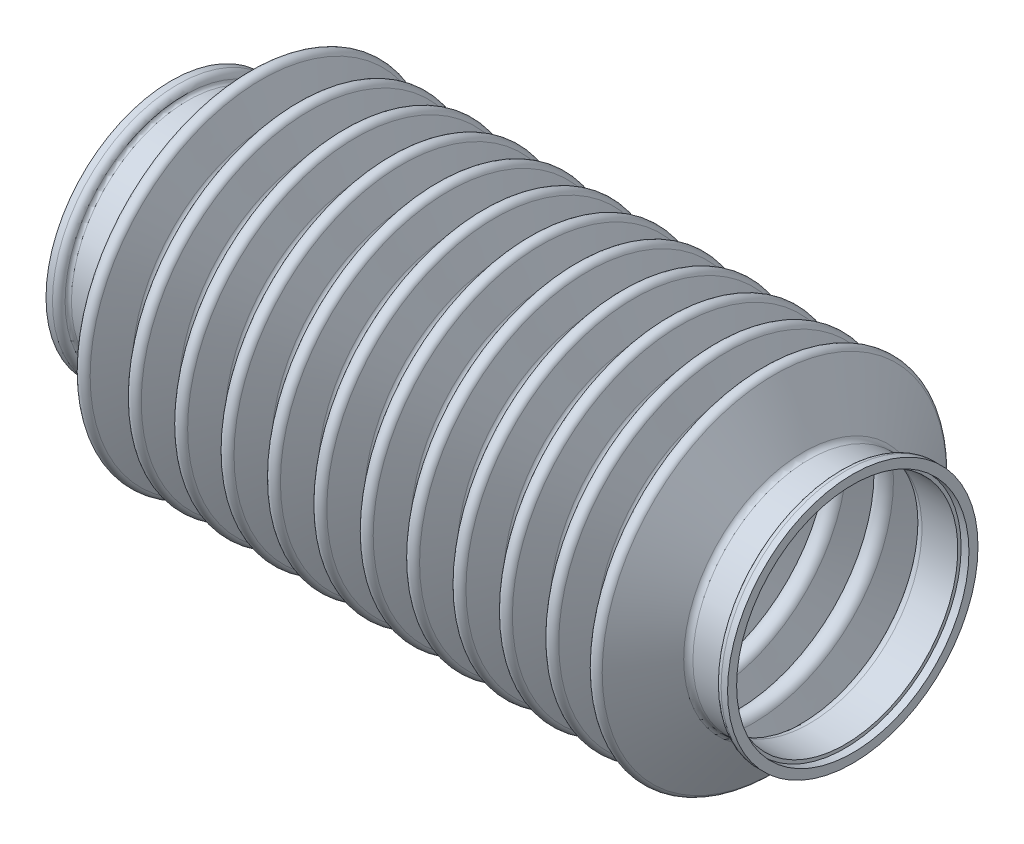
ISO-10303-21;
HEADER;
FILE_DESCRIPTION(('STEP AP214'),'2;1');
FILE_NAME('part.step','',(''),(''),'','','');
FILE_SCHEMA(('AUTOMOTIVE_DESIGN { 1 0 10303 214 1 1 1 1 }'));
ENDSEC;
DATA;
#1=APPLICATION_CONTEXT('core data for automotive mechanical design processes');
#2=APPLICATION_PROTOCOL_DEFINITION('international standard','automotive_design',2000,#1);
#3=PRODUCT_CONTEXT('',#1,'mechanical');
#4=PRODUCT('Part','Part','',(#3));
#5=PRODUCT_RELATED_PRODUCT_CATEGORY('part','',(#4));
#6=PRODUCT_DEFINITION_FORMATION('','',#4);
#7=PRODUCT_DEFINITION_CONTEXT('part definition',#1,'design');
#8=PRODUCT_DEFINITION('design','',#6,#7);
#9=PRODUCT_DEFINITION_SHAPE('','',#8);
#10=(LENGTH_UNIT() NAMED_UNIT(*) SI_UNIT(.MILLI.,.METRE.));
#11=(NAMED_UNIT(*) PLANE_ANGLE_UNIT() SI_UNIT($,.RADIAN.));
#12=(NAMED_UNIT(*) SI_UNIT($,.STERADIAN.) SOLID_ANGLE_UNIT());
#13=UNCERTAINTY_MEASURE_WITH_UNIT(LENGTH_MEASURE(1.E-05),#10,'distance_accuracy_value','');
#14=(GEOMETRIC_REPRESENTATION_CONTEXT(3) GLOBAL_UNCERTAINTY_ASSIGNED_CONTEXT((#13)) GLOBAL_UNIT_ASSIGNED_CONTEXT((#10,
#11,#12)) REPRESENTATION_CONTEXT('',''));
#15=CARTESIAN_POINT('',(0.,0.,0.));
#16=DIRECTION('',(0.,0.,1.));
#17=DIRECTION('',(1.,0.,0.));
#18=AXIS2_PLACEMENT_3D('',#15,#16,#17);
#19=CARTESIAN_POINT('',(-52.9347245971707,0.,0.));
#20=DIRECTION('',(-1.,0.,0.));
#21=DIRECTION('',(0.,0.,1.));
#22=AXIS2_PLACEMENT_3D('',#19,#20,#21);
#23=TOROIDAL_SURFACE('',#22,37.0586449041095,2.);
#24=CARTESIAN_POINT('',(-52.9347245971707,0.,0.));
#25=DIRECTION('',(-1.,0.,0.));
#26=DIRECTION('',(0.,0.,1.));
#27=AXIS2_PLACEMENT_3D('',#24,#25,#26);
#28=CIRCLE('',#27,35.0586449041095);
#29=CARTESIAN_POINT('',(-52.9347245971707,0.,35.0586449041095));
#30=VERTEX_POINT('',#29);
#31=EDGE_CURVE('E375',#30,#30,#28,.T.);
#32=ORIENTED_EDGE('',*,*,#31,.F.);
#33=EDGE_LOOP('',(#32));
#34=FACE_BOUND('',#33,.T.);
#35=CARTESIAN_POINT('',(-51.1833325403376,0.,0.));
#36=DIRECTION('',(-1.,0.,0.));
#37=DIRECTION('',(0.,0.,1.));
#38=AXIS2_PLACEMENT_3D('',#35,#36,#37);
#39=CIRCLE('',#38,36.0929193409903);
#40=CARTESIAN_POINT('',(-51.1833325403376,0.,36.0929193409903));
#41=VERTEX_POINT('',#40);
#42=EDGE_CURVE('E10',#41,#41,#39,.T.);
#43=ORIENTED_EDGE('',*,*,#42,.T.);
#44=EDGE_LOOP('',(#43));
#45=FACE_BOUND('',#44,.T.);
#46=ADVANCED_FACE('F29',(#34,#45),#23,.F.);
#47=CARTESIAN_POINT('',(-42.4423336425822,0.,0.));
#48=DIRECTION('',(1.,0.,0.));
#49=DIRECTION('',(0.,0.,-1.));
#50=AXIS2_PLACEMENT_3D('',#47,#48,#49);
#51=CONICAL_SURFACE('',#50,51.9451620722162,1.06687539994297);
#52=ORIENTED_EDGE('',*,*,#42,.F.);
#53=EDGE_LOOP('',(#52));
#54=FACE_BOUND('',#53,.T.);
#55=CARTESIAN_POINT('',(-42.4423336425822,0.,0.));
#56=DIRECTION('',(-1.,0.,0.));
#57=DIRECTION('',(0.,0.,1.));
#58=AXIS2_PLACEMENT_3D('',#55,#56,#57);
#59=CIRCLE('',#58,51.9451620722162);
#60=CARTESIAN_POINT('',(-42.4423336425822,0.,51.9451620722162));
#61=VERTEX_POINT('',#60);
#62=EDGE_CURVE('E35',#61,#61,#59,.T.);
#63=ORIENTED_EDGE('',*,*,#62,.T.);
#64=EDGE_LOOP('',(#63));
#65=FACE_BOUND('',#64,.T.);
#66=ADVANCED_FACE('F382',(#54,#65),#51,.T.);
#67=CARTESIAN_POINT('',(-40.690941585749,0.,0.));
#68=DIRECTION('',(-1.,0.,0.));
#69=DIRECTION('',(0.,0.,1.));
#70=AXIS2_PLACEMENT_3D('',#67,#68,#69);
#71=TOROIDAL_SURFACE('',#70,50.979436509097,2.);
#72=ORIENTED_EDGE('',*,*,#62,.F.);
#73=EDGE_LOOP('',(#72));
#74=FACE_BOUND('',#73,.T.);
#75=CARTESIAN_POINT('',(-38.8422559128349,0.,0.));
#76=DIRECTION('',(-1.,0.,0.));
#77=DIRECTION('',(0.,0.,1.));
#78=AXIS2_PLACEMENT_3D('',#75,#76,#77);
#79=CIRCLE('',#78,51.7425625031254);
#80=CARTESIAN_POINT('',(-38.8422559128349,0.,51.7425625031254));
#81=VERTEX_POINT('',#80);
#82=EDGE_CURVE('E39',#81,#81,#79,.T.);
#83=ORIENTED_EDGE('',*,*,#82,.T.);
#84=EDGE_LOOP('',(#83));
#85=FACE_BOUND('',#84,.T.);
#86=ADVANCED_FACE('F386',(#74,#85),#71,.T.);
#87=CARTESIAN_POINT('',(-35.1247521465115,0.,0.));
#88=DIRECTION('',(-1.,0.,0.));
#89=DIRECTION('',(0.,0.,1.));
#90=AXIS2_PLACEMENT_3D('',#87,#88,#89);
#91=CONICAL_SURFACE('',#90,42.7368465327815,1.17930969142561);
#92=ORIENTED_EDGE('',*,*,#82,.F.);
#93=EDGE_LOOP('',(#92));
#94=FACE_BOUND('',#93,.T.);
#95=CARTESIAN_POINT('',(-35.1247521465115,0.,0.));
#96=DIRECTION('',(-1.,0.,0.));
#97=DIRECTION('',(0.,0.,1.));
#98=AXIS2_PLACEMENT_3D('',#95,#96,#97);
#99=CIRCLE('',#98,42.7368465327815);
#100=CARTESIAN_POINT('',(-35.1247521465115,0.,42.7368465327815));
#101=VERTEX_POINT('',#100);
#102=EDGE_CURVE('E43',#101,#101,#99,.T.);
#103=ORIENTED_EDGE('',*,*,#102,.T.);
#104=EDGE_LOOP('',(#103));
#105=FACE_BOUND('',#104,.T.);
#106=ADVANCED_FACE('F391',(#94,#105),#91,.T.);
#107=CARTESIAN_POINT('',(-33.2760664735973,0.,0.));
#108=DIRECTION('',(-1.,0.,0.));
#109=DIRECTION('',(0.,0.,1.));
#110=AXIS2_PLACEMENT_3D('',#107,#108,#109);
#111=TOROIDAL_SURFACE('',#110,43.4999725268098,2.);
#112=ORIENTED_EDGE('',*,*,#102,.F.);
#113=EDGE_LOOP('',(#112));
#114=FACE_BOUND('',#113,.T.);
#115=CARTESIAN_POINT('',(-31.4273808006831,0.,0.));
#116=DIRECTION('',(-1.,0.,0.));
#117=DIRECTION('',(0.,0.,1.));
#118=AXIS2_PLACEMENT_3D('',#115,#116,#117);
#119=CIRCLE('',#118,42.7368465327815);
#120=CARTESIAN_POINT('',(-31.4273808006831,0.,42.7368465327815));
#121=VERTEX_POINT('',#120);
#122=EDGE_CURVE('E48',#121,#121,#119,.T.);
#123=ORIENTED_EDGE('',*,*,#122,.T.);
#124=EDGE_LOOP('',(#123));
#125=FACE_BOUND('',#124,.T.);
#126=ADVANCED_FACE('F397',(#114,#125),#111,.F.);
#127=CARTESIAN_POINT('',(-28.1247521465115,0.,0.));
#128=DIRECTION('',(1.,0.,0.));
#129=DIRECTION('',(0.,0.,-1.));
#130=AXIS2_PLACEMENT_3D('',#127,#128,#129);
#131=CONICAL_SURFACE('',#130,50.737520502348,1.17930969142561);
#132=ORIENTED_EDGE('',*,*,#122,.F.);
#133=EDGE_LOOP('',(#132));
#134=FACE_BOUND('',#133,.T.);
#135=CARTESIAN_POINT('',(-28.1247521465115,0.,0.));
#136=DIRECTION('',(-1.,0.,0.));
#137=DIRECTION('',(0.,0.,1.));
#138=AXIS2_PLACEMENT_3D('',#135,#136,#137);
#139=CIRCLE('',#138,50.737520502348);
#140=CARTESIAN_POINT('',(-28.1247521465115,0.,50.737520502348));
#141=VERTEX_POINT('',#140);
#142=EDGE_CURVE('E51',#141,#141,#139,.T.);
#143=ORIENTED_EDGE('',*,*,#142,.T.);
#144=EDGE_LOOP('',(#143));
#145=FACE_BOUND('',#144,.T.);
#146=ADVANCED_FACE('F401',(#134,#145),#131,.T.);
#147=CARTESIAN_POINT('',(-26.2760664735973,0.,0.));
#148=DIRECTION('',(-1.,0.,0.));
#149=DIRECTION('',(0.,0.,1.));
#150=AXIS2_PLACEMENT_3D('',#147,#148,#149);
#151=TOROIDAL_SURFACE('',#150,49.9743945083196,2.);
#152=ORIENTED_EDGE('',*,*,#142,.F.);
#153=EDGE_LOOP('',(#152));
#154=FACE_BOUND('',#153,.T.);
#155=CARTESIAN_POINT('',(-24.4273808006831,0.,0.));
#156=DIRECTION('',(-1.,0.,0.));
#157=DIRECTION('',(0.,0.,1.));
#158=AXIS2_PLACEMENT_3D('',#155,#156,#157);
#159=CIRCLE('',#158,50.737520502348);
#160=CARTESIAN_POINT('',(-24.4273808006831,0.,50.737520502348));
#161=VERTEX_POINT('',#160);
#162=EDGE_CURVE('E54',#161,#161,#159,.T.);
#163=ORIENTED_EDGE('',*,*,#162,.T.);
#164=EDGE_LOOP('',(#163));
#165=FACE_BOUND('',#164,.T.);
#166=ADVANCED_FACE('F405',(#154,#165),#151,.T.);
#167=CARTESIAN_POINT('',(-21.1247521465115,0.,0.));
#168=DIRECTION('',(-1.,0.,0.));
#169=DIRECTION('',(0.,0.,1.));
#170=AXIS2_PLACEMENT_3D('',#167,#168,#169);
#171=CONICAL_SURFACE('',#170,42.7368465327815,1.17930969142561);
#172=ORIENTED_EDGE('',*,*,#162,.F.);
#173=EDGE_LOOP('',(#172));
#174=FACE_BOUND('',#173,.T.);
#175=CARTESIAN_POINT('',(-21.1247521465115,0.,0.));
#176=DIRECTION('',(-1.,0.,0.));
#177=DIRECTION('',(0.,0.,1.));
#178=AXIS2_PLACEMENT_3D('',#175,#176,#177);
#179=CIRCLE('',#178,42.7368465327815);
#180=CARTESIAN_POINT('',(-21.1247521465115,0.,42.7368465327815));
#181=VERTEX_POINT('',#180);
#182=EDGE_CURVE('E57',#181,#181,#179,.T.);
#183=ORIENTED_EDGE('',*,*,#182,.T.);
#184=EDGE_LOOP('',(#183));
#185=FACE_BOUND('',#184,.T.);
#186=ADVANCED_FACE('F409',(#174,#185),#171,.T.);
#187=CARTESIAN_POINT('',(-19.2760664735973,0.,0.));
#188=DIRECTION('',(-1.,0.,0.));
#189=DIRECTION('',(0.,0.,1.));
#190=AXIS2_PLACEMENT_3D('',#187,#188,#189);
#191=TOROIDAL_SURFACE('',#190,43.4999725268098,2.);
#192=ORIENTED_EDGE('',*,*,#182,.F.);
#193=EDGE_LOOP('',(#192));
#194=FACE_BOUND('',#193,.T.);
#195=CARTESIAN_POINT('',(-17.4273808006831,0.,0.));
#196=DIRECTION('',(-1.,0.,0.));
#197=DIRECTION('',(0.,0.,1.));
#198=AXIS2_PLACEMENT_3D('',#195,#196,#197);
#199=CIRCLE('',#198,42.7368465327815);
#200=CARTESIAN_POINT('',(-17.4273808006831,0.,42.7368465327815));
#201=VERTEX_POINT('',#200);
#202=EDGE_CURVE('E60',#201,#201,#199,.T.);
#203=ORIENTED_EDGE('',*,*,#202,.T.);
#204=EDGE_LOOP('',(#203));
#205=FACE_BOUND('',#204,.T.);
#206=ADVANCED_FACE('F413',(#194,#205),#191,.F.);
#207=CARTESIAN_POINT('',(-14.1247521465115,0.,0.));
#208=DIRECTION('',(1.,0.,0.));
#209=DIRECTION('',(0.,0.,-1.));
#210=AXIS2_PLACEMENT_3D('',#207,#208,#209);
#211=CONICAL_SURFACE('',#210,50.737520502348,1.17930969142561);
#212=ORIENTED_EDGE('',*,*,#202,.F.);
#213=EDGE_LOOP('',(#212));
#214=FACE_BOUND('',#213,.T.);
#215=CARTESIAN_POINT('',(-14.1247521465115,0.,0.));
#216=DIRECTION('',(-1.,0.,0.));
#217=DIRECTION('',(0.,0.,1.));
#218=AXIS2_PLACEMENT_3D('',#215,#216,#217);
#219=CIRCLE('',#218,50.737520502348);
#220=CARTESIAN_POINT('',(-14.1247521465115,0.,50.737520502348));
#221=VERTEX_POINT('',#220);
#222=EDGE_CURVE('E63',#221,#221,#219,.T.);
#223=ORIENTED_EDGE('',*,*,#222,.T.);
#224=EDGE_LOOP('',(#223));
#225=FACE_BOUND('',#224,.T.);
#226=ADVANCED_FACE('F417',(#214,#225),#211,.T.);
#227=CARTESIAN_POINT('',(-12.2760664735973,0.,0.));
#228=DIRECTION('',(-1.,0.,0.));
#229=DIRECTION('',(0.,0.,1.));
#230=AXIS2_PLACEMENT_3D('',#227,#228,#229);
#231=TOROIDAL_SURFACE('',#230,49.9743945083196,2.);
#232=ORIENTED_EDGE('',*,*,#222,.F.);
#233=EDGE_LOOP('',(#232));
#234=FACE_BOUND('',#233,.T.);
#235=CARTESIAN_POINT('',(-10.4273808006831,0.,0.));
#236=DIRECTION('',(-1.,0.,0.));
#237=DIRECTION('',(0.,0.,1.));
#238=AXIS2_PLACEMENT_3D('',#235,#236,#237);
#239=CIRCLE('',#238,50.737520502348);
#240=CARTESIAN_POINT('',(-10.4273808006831,0.,50.737520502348));
#241=VERTEX_POINT('',#240);
#242=EDGE_CURVE('E66',#241,#241,#239,.T.);
#243=ORIENTED_EDGE('',*,*,#242,.T.);
#244=EDGE_LOOP('',(#243));
#245=FACE_BOUND('',#244,.T.);
#246=ADVANCED_FACE('F421',(#234,#245),#231,.T.);
#247=CARTESIAN_POINT('',(-7.12475214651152,0.,0.));
#248=DIRECTION('',(-1.,0.,0.));
#249=DIRECTION('',(0.,0.,1.));
#250=AXIS2_PLACEMENT_3D('',#247,#248,#249);
#251=CONICAL_SURFACE('',#250,42.7368465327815,1.17930969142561);
#252=ORIENTED_EDGE('',*,*,#242,.F.);
#253=EDGE_LOOP('',(#252));
#254=FACE_BOUND('',#253,.T.);
#255=CARTESIAN_POINT('',(-7.12475214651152,0.,0.));
#256=DIRECTION('',(-1.,0.,0.));
#257=DIRECTION('',(0.,0.,1.));
#258=AXIS2_PLACEMENT_3D('',#255,#256,#257);
#259=CIRCLE('',#258,42.7368465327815);
#260=CARTESIAN_POINT('',(-7.12475214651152,0.,42.7368465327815));
#261=VERTEX_POINT('',#260);
#262=EDGE_CURVE('E69',#261,#261,#259,.T.);
#263=ORIENTED_EDGE('',*,*,#262,.T.);
#264=EDGE_LOOP('',(#263));
#265=FACE_BOUND('',#264,.T.);
#266=ADVANCED_FACE('F425',(#254,#265),#251,.T.);
#267=CARTESIAN_POINT('',(-5.27606647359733,0.,0.));
#268=DIRECTION('',(-1.,0.,0.));
#269=DIRECTION('',(0.,0.,1.));
#270=AXIS2_PLACEMENT_3D('',#267,#268,#269);
#271=TOROIDAL_SURFACE('',#270,43.4999725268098,2.);
#272=ORIENTED_EDGE('',*,*,#262,.F.);
#273=EDGE_LOOP('',(#272));
#274=FACE_BOUND('',#273,.T.);
#275=CARTESIAN_POINT('',(-3.42738080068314,0.,0.));
#276=DIRECTION('',(-1.,0.,0.));
#277=DIRECTION('',(0.,0.,1.));
#278=AXIS2_PLACEMENT_3D('',#275,#276,#277);
#279=CIRCLE('',#278,42.7368465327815);
#280=CARTESIAN_POINT('',(-3.42738080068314,0.,42.7368465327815));
#281=VERTEX_POINT('',#280);
#282=EDGE_CURVE('E72',#281,#281,#279,.T.);
#283=ORIENTED_EDGE('',*,*,#282,.T.);
#284=EDGE_LOOP('',(#283));
#285=FACE_BOUND('',#284,.T.);
#286=ADVANCED_FACE('F429',(#274,#285),#271,.F.);
#287=CARTESIAN_POINT('',(-0.124752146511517,0.,0.));
#288=DIRECTION('',(1.,0.,0.));
#289=DIRECTION('',(0.,0.,-1.));
#290=AXIS2_PLACEMENT_3D('',#287,#288,#289);
#291=CONICAL_SURFACE('',#290,50.737520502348,1.17930969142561);
#292=ORIENTED_EDGE('',*,*,#282,.F.);
#293=EDGE_LOOP('',(#292));
#294=FACE_BOUND('',#293,.T.);
#295=CARTESIAN_POINT('',(-0.124752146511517,0.,0.));
#296=DIRECTION('',(-1.,0.,0.));
#297=DIRECTION('',(0.,0.,1.));
#298=AXIS2_PLACEMENT_3D('',#295,#296,#297);
#299=CIRCLE('',#298,50.737520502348);
#300=CARTESIAN_POINT('',(-0.124752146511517,0.,50.737520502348));
#301=VERTEX_POINT('',#300);
#302=EDGE_CURVE('E75',#301,#301,#299,.T.);
#303=ORIENTED_EDGE('',*,*,#302,.T.);
#304=EDGE_LOOP('',(#303));
#305=FACE_BOUND('',#304,.T.);
#306=ADVANCED_FACE('F433',(#294,#305),#291,.T.);
#307=CARTESIAN_POINT('',(1.72393352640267,0.,0.));
#308=DIRECTION('',(-1.,0.,0.));
#309=DIRECTION('',(0.,0.,1.));
#310=AXIS2_PLACEMENT_3D('',#307,#308,#309);
#311=TOROIDAL_SURFACE('',#310,49.9743945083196,2.);
#312=ORIENTED_EDGE('',*,*,#302,.F.);
#313=EDGE_LOOP('',(#312));
#314=FACE_BOUND('',#313,.T.);
#315=CARTESIAN_POINT('',(3.57261919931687,0.,0.));
#316=DIRECTION('',(-1.,0.,0.));
#317=DIRECTION('',(0.,0.,1.));
#318=AXIS2_PLACEMENT_3D('',#315,#316,#317);
#319=CIRCLE('',#318,50.737520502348);
#320=CARTESIAN_POINT('',(3.57261919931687,0.,50.737520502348));
#321=VERTEX_POINT('',#320);
#322=EDGE_CURVE('E78',#321,#321,#319,.T.);
#323=ORIENTED_EDGE('',*,*,#322,.T.);
#324=EDGE_LOOP('',(#323));
#325=FACE_BOUND('',#324,.T.);
#326=ADVANCED_FACE('F437',(#314,#325),#311,.T.);
#327=CARTESIAN_POINT('',(6.87524785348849,0.,0.));
#328=DIRECTION('',(-1.,0.,0.));
#329=DIRECTION('',(0.,0.,1.));
#330=AXIS2_PLACEMENT_3D('',#327,#328,#329);
#331=CONICAL_SURFACE('',#330,42.7368465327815,1.17930969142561);
#332=ORIENTED_EDGE('',*,*,#322,.F.);
#333=EDGE_LOOP('',(#332));
#334=FACE_BOUND('',#333,.T.);
#335=CARTESIAN_POINT('',(6.87524785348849,0.,0.));
#336=DIRECTION('',(-1.,0.,0.));
#337=DIRECTION('',(0.,0.,1.));
#338=AXIS2_PLACEMENT_3D('',#335,#336,#337);
#339=CIRCLE('',#338,42.7368465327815);
#340=CARTESIAN_POINT('',(6.87524785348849,0.,42.7368465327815));
#341=VERTEX_POINT('',#340);
#342=EDGE_CURVE('E81',#341,#341,#339,.T.);
#343=ORIENTED_EDGE('',*,*,#342,.T.);
#344=EDGE_LOOP('',(#343));
#345=FACE_BOUND('',#344,.T.);
#346=ADVANCED_FACE('F441',(#334,#345),#331,.T.);
#347=CARTESIAN_POINT('',(8.72393352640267,0.,0.));
#348=DIRECTION('',(-1.,0.,0.));
#349=DIRECTION('',(0.,0.,1.));
#350=AXIS2_PLACEMENT_3D('',#347,#348,#349);
#351=TOROIDAL_SURFACE('',#350,43.4999725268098,2.);
#352=ORIENTED_EDGE('',*,*,#342,.F.);
#353=EDGE_LOOP('',(#352));
#354=FACE_BOUND('',#353,.T.);
#355=CARTESIAN_POINT('',(10.5726191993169,0.,0.));
#356=DIRECTION('',(-1.,0.,0.));
#357=DIRECTION('',(0.,0.,1.));
#358=AXIS2_PLACEMENT_3D('',#355,#356,#357);
#359=CIRCLE('',#358,42.7368465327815);
#360=CARTESIAN_POINT('',(10.5726191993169,0.,42.7368465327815));
#361=VERTEX_POINT('',#360);
#362=EDGE_CURVE('E84',#361,#361,#359,.T.);
#363=ORIENTED_EDGE('',*,*,#362,.T.);
#364=EDGE_LOOP('',(#363));
#365=FACE_BOUND('',#364,.T.);
#366=ADVANCED_FACE('F445',(#354,#365),#351,.F.);
#367=CARTESIAN_POINT('',(13.8752478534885,0.,0.));
#368=DIRECTION('',(1.,0.,0.));
#369=DIRECTION('',(0.,0.,-1.));
#370=AXIS2_PLACEMENT_3D('',#367,#368,#369);
#371=CONICAL_SURFACE('',#370,50.737520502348,1.17930969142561);
#372=ORIENTED_EDGE('',*,*,#362,.F.);
#373=EDGE_LOOP('',(#372));
#374=FACE_BOUND('',#373,.T.);
#375=CARTESIAN_POINT('',(13.8752478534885,0.,0.));
#376=DIRECTION('',(-1.,0.,0.));
#377=DIRECTION('',(0.,0.,1.));
#378=AXIS2_PLACEMENT_3D('',#375,#376,#377);
#379=CIRCLE('',#378,50.737520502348);
#380=CARTESIAN_POINT('',(13.8752478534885,0.,50.737520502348));
#381=VERTEX_POINT('',#380);
#382=EDGE_CURVE('E87',#381,#381,#379,.T.);
#383=ORIENTED_EDGE('',*,*,#382,.T.);
#384=EDGE_LOOP('',(#383));
#385=FACE_BOUND('',#384,.T.);
#386=ADVANCED_FACE('F449',(#374,#385),#371,.T.);
#387=CARTESIAN_POINT('',(15.7239335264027,0.,0.));
#388=DIRECTION('',(-1.,0.,0.));
#389=DIRECTION('',(0.,0.,1.));
#390=AXIS2_PLACEMENT_3D('',#387,#388,#389);
#391=TOROIDAL_SURFACE('',#390,49.9743945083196,2.);
#392=ORIENTED_EDGE('',*,*,#382,.F.);
#393=EDGE_LOOP('',(#392));
#394=FACE_BOUND('',#393,.T.);
#395=CARTESIAN_POINT('',(17.5726191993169,0.,0.));
#396=DIRECTION('',(-1.,0.,0.));
#397=DIRECTION('',(0.,0.,1.));
#398=AXIS2_PLACEMENT_3D('',#395,#396,#397);
#399=CIRCLE('',#398,50.737520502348);
#400=CARTESIAN_POINT('',(17.5726191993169,0.,50.737520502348));
#401=VERTEX_POINT('',#400);
#402=EDGE_CURVE('E90',#401,#401,#399,.T.);
#403=ORIENTED_EDGE('',*,*,#402,.T.);
#404=EDGE_LOOP('',(#403));
#405=FACE_BOUND('',#404,.T.);
#406=ADVANCED_FACE('F453',(#394,#405),#391,.T.);
#407=CARTESIAN_POINT('',(20.8752478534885,0.,0.));
#408=DIRECTION('',(-1.,0.,0.));
#409=DIRECTION('',(0.,0.,1.));
#410=AXIS2_PLACEMENT_3D('',#407,#408,#409);
#411=CONICAL_SURFACE('',#410,42.7368465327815,1.17930969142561);
#412=ORIENTED_EDGE('',*,*,#402,.F.);
#413=EDGE_LOOP('',(#412));
#414=FACE_BOUND('',#413,.T.);
#415=CARTESIAN_POINT('',(20.8752478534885,0.,0.));
#416=DIRECTION('',(-1.,0.,0.));
#417=DIRECTION('',(0.,0.,1.));
#418=AXIS2_PLACEMENT_3D('',#415,#416,#417);
#419=CIRCLE('',#418,42.7368465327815);
#420=CARTESIAN_POINT('',(20.8752478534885,0.,42.7368465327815));
#421=VERTEX_POINT('',#420);
#422=EDGE_CURVE('E93',#421,#421,#419,.T.);
#423=ORIENTED_EDGE('',*,*,#422,.T.);
#424=EDGE_LOOP('',(#423));
#425=FACE_BOUND('',#424,.T.);
#426=ADVANCED_FACE('F457',(#414,#425),#411,.T.);
#427=CARTESIAN_POINT('',(22.7239335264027,0.,0.));
#428=DIRECTION('',(-1.,0.,0.));
#429=DIRECTION('',(0.,0.,1.));
#430=AXIS2_PLACEMENT_3D('',#427,#428,#429);
#431=TOROIDAL_SURFACE('',#430,43.4999725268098,2.);
#432=ORIENTED_EDGE('',*,*,#422,.F.);
#433=EDGE_LOOP('',(#432));
#434=FACE_BOUND('',#433,.T.);
#435=CARTESIAN_POINT('',(24.5726191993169,0.,0.));
#436=DIRECTION('',(-1.,0.,0.));
#437=DIRECTION('',(0.,0.,1.));
#438=AXIS2_PLACEMENT_3D('',#435,#436,#437);
#439=CIRCLE('',#438,42.7368465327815);
#440=CARTESIAN_POINT('',(24.5726191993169,0.,42.7368465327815));
#441=VERTEX_POINT('',#440);
#442=EDGE_CURVE('E96',#441,#441,#439,.T.);
#443=ORIENTED_EDGE('',*,*,#442,.T.);
#444=EDGE_LOOP('',(#443));
#445=FACE_BOUND('',#444,.T.);
#446=ADVANCED_FACE('F461',(#434,#445),#431,.F.);
#447=CARTESIAN_POINT('',(27.8752478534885,0.,0.));
#448=DIRECTION('',(1.,0.,0.));
#449=DIRECTION('',(0.,0.,-1.));
#450=AXIS2_PLACEMENT_3D('',#447,#448,#449);
#451=CONICAL_SURFACE('',#450,50.737520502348,1.17930969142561);
#452=ORIENTED_EDGE('',*,*,#442,.F.);
#453=EDGE_LOOP('',(#452));
#454=FACE_BOUND('',#453,.T.);
#455=CARTESIAN_POINT('',(27.8752478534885,0.,0.));
#456=DIRECTION('',(-1.,0.,0.));
#457=DIRECTION('',(0.,0.,1.));
#458=AXIS2_PLACEMENT_3D('',#455,#456,#457);
#459=CIRCLE('',#458,50.737520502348);
#460=CARTESIAN_POINT('',(27.8752478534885,0.,50.737520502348));
#461=VERTEX_POINT('',#460);
#462=EDGE_CURVE('E99',#461,#461,#459,.T.);
#463=ORIENTED_EDGE('',*,*,#462,.T.);
#464=EDGE_LOOP('',(#463));
#465=FACE_BOUND('',#464,.T.);
#466=ADVANCED_FACE('F465',(#454,#465),#451,.T.);
#467=CARTESIAN_POINT('',(29.7239335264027,0.,0.));
#468=DIRECTION('',(-1.,0.,0.));
#469=DIRECTION('',(0.,0.,1.));
#470=AXIS2_PLACEMENT_3D('',#467,#468,#469);
#471=TOROIDAL_SURFACE('',#470,49.9743945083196,2.);
#472=ORIENTED_EDGE('',*,*,#462,.F.);
#473=EDGE_LOOP('',(#472));
#474=FACE_BOUND('',#473,.T.);
#475=CARTESIAN_POINT('',(31.5726191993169,0.,0.));
#476=DIRECTION('',(-1.,0.,0.));
#477=DIRECTION('',(0.,0.,1.));
#478=AXIS2_PLACEMENT_3D('',#475,#476,#477);
#479=CIRCLE('',#478,50.737520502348);
#480=CARTESIAN_POINT('',(31.5726191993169,0.,50.737520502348));
#481=VERTEX_POINT('',#480);
#482=EDGE_CURVE('E102',#481,#481,#479,.T.);
#483=ORIENTED_EDGE('',*,*,#482,.T.);
#484=EDGE_LOOP('',(#483));
#485=FACE_BOUND('',#484,.T.);
#486=ADVANCED_FACE('F469',(#474,#485),#471,.T.);
#487=CARTESIAN_POINT('',(34.8752478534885,0.,0.));
#488=DIRECTION('',(-1.,0.,0.));
#489=DIRECTION('',(0.,0.,1.));
#490=AXIS2_PLACEMENT_3D('',#487,#488,#489);
#491=CONICAL_SURFACE('',#490,42.7368465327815,1.17930969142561);
#492=ORIENTED_EDGE('',*,*,#482,.F.);
#493=EDGE_LOOP('',(#492));
#494=FACE_BOUND('',#493,.T.);
#495=CARTESIAN_POINT('',(34.8752478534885,0.,0.));
#496=DIRECTION('',(-1.,0.,0.));
#497=DIRECTION('',(0.,0.,1.));
#498=AXIS2_PLACEMENT_3D('',#495,#496,#497);
#499=CIRCLE('',#498,42.7368465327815);
#500=CARTESIAN_POINT('',(34.8752478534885,0.,42.7368465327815));
#501=VERTEX_POINT('',#500);
#502=EDGE_CURVE('E105',#501,#501,#499,.T.);
#503=ORIENTED_EDGE('',*,*,#502,.T.);
#504=EDGE_LOOP('',(#503));
#505=FACE_BOUND('',#504,.T.);
#506=ADVANCED_FACE('F473',(#494,#505),#491,.T.);
#507=CARTESIAN_POINT('',(36.7239335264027,0.,0.));
#508=DIRECTION('',(-1.,0.,0.));
#509=DIRECTION('',(0.,0.,1.));
#510=AXIS2_PLACEMENT_3D('',#507,#508,#509);
#511=TOROIDAL_SURFACE('',#510,43.4999725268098,2.);
#512=ORIENTED_EDGE('',*,*,#502,.F.);
#513=EDGE_LOOP('',(#512));
#514=FACE_BOUND('',#513,.T.);
#515=CARTESIAN_POINT('',(38.5726191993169,0.,0.));
#516=DIRECTION('',(-1.,0.,0.));
#517=DIRECTION('',(0.,0.,1.));
#518=AXIS2_PLACEMENT_3D('',#515,#516,#517);
#519=CIRCLE('',#518,42.7368465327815);
#520=CARTESIAN_POINT('',(38.5726191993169,0.,42.7368465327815));
#521=VERTEX_POINT('',#520);
#522=EDGE_CURVE('E108',#521,#521,#519,.T.);
#523=ORIENTED_EDGE('',*,*,#522,.T.);
#524=EDGE_LOOP('',(#523));
#525=FACE_BOUND('',#524,.T.);
#526=ADVANCED_FACE('F477',(#514,#525),#511,.F.);
#527=CARTESIAN_POINT('',(41.8752478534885,0.,0.));
#528=DIRECTION('',(1.,0.,0.));
#529=DIRECTION('',(0.,0.,-1.));
#530=AXIS2_PLACEMENT_3D('',#527,#528,#529);
#531=CONICAL_SURFACE('',#530,50.737520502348,1.17930969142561);
#532=ORIENTED_EDGE('',*,*,#522,.F.);
#533=EDGE_LOOP('',(#532));
#534=FACE_BOUND('',#533,.T.);
#535=CARTESIAN_POINT('',(41.8752478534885,0.,0.));
#536=DIRECTION('',(-1.,0.,0.));
#537=DIRECTION('',(0.,0.,1.));
#538=AXIS2_PLACEMENT_3D('',#535,#536,#537);
#539=CIRCLE('',#538,50.737520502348);
#540=CARTESIAN_POINT('',(41.8752478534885,0.,50.737520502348));
#541=VERTEX_POINT('',#540);
#542=EDGE_CURVE('E111',#541,#541,#539,.T.);
#543=ORIENTED_EDGE('',*,*,#542,.T.);
#544=EDGE_LOOP('',(#543));
#545=FACE_BOUND('',#544,.T.);
#546=ADVANCED_FACE('F481',(#534,#545),#531,.T.);
#547=CARTESIAN_POINT('',(43.7239335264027,0.,0.));
#548=DIRECTION('',(-1.,0.,0.));
#549=DIRECTION('',(0.,0.,1.));
#550=AXIS2_PLACEMENT_3D('',#547,#548,#549);
#551=TOROIDAL_SURFACE('',#550,49.9743945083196,2.);
#552=ORIENTED_EDGE('',*,*,#542,.F.);
#553=EDGE_LOOP('',(#552));
#554=FACE_BOUND('',#553,.T.);
#555=CARTESIAN_POINT('',(45.5726191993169,0.,0.));
#556=DIRECTION('',(-1.,0.,0.));
#557=DIRECTION('',(0.,0.,1.));
#558=AXIS2_PLACEMENT_3D('',#555,#556,#557);
#559=CIRCLE('',#558,50.737520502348);
#560=CARTESIAN_POINT('',(45.5726191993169,0.,50.737520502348));
#561=VERTEX_POINT('',#560);
#562=EDGE_CURVE('E114',#561,#561,#559,.T.);
#563=ORIENTED_EDGE('',*,*,#562,.T.);
#564=EDGE_LOOP('',(#563));
#565=FACE_BOUND('',#564,.T.);
#566=ADVANCED_FACE('F485',(#554,#565),#551,.T.);
#567=CARTESIAN_POINT('',(48.8752478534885,0.,0.));
#568=DIRECTION('',(-1.,0.,0.));
#569=DIRECTION('',(0.,0.,1.));
#570=AXIS2_PLACEMENT_3D('',#567,#568,#569);
#571=CONICAL_SURFACE('',#570,42.7368465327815,1.17930969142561);
#572=ORIENTED_EDGE('',*,*,#562,.F.);
#573=EDGE_LOOP('',(#572));
#574=FACE_BOUND('',#573,.T.);
#575=CARTESIAN_POINT('',(48.8752478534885,0.,0.));
#576=DIRECTION('',(-1.,0.,0.));
#577=DIRECTION('',(0.,0.,1.));
#578=AXIS2_PLACEMENT_3D('',#575,#576,#577);
#579=CIRCLE('',#578,42.7368465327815);
#580=CARTESIAN_POINT('',(48.8752478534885,0.,42.7368465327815));
#581=VERTEX_POINT('',#580);
#582=EDGE_CURVE('E117',#581,#581,#579,.T.);
#583=ORIENTED_EDGE('',*,*,#582,.T.);
#584=EDGE_LOOP('',(#583));
#585=FACE_BOUND('',#584,.T.);
#586=ADVANCED_FACE('F489',(#574,#585),#571,.T.);
#587=CARTESIAN_POINT('',(50.7239335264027,0.,0.));
#588=DIRECTION('',(-1.,0.,0.));
#589=DIRECTION('',(0.,0.,1.));
#590=AXIS2_PLACEMENT_3D('',#587,#588,#589);
#591=TOROIDAL_SURFACE('',#590,43.4999725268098,2.);
#592=ORIENTED_EDGE('',*,*,#582,.F.);
#593=EDGE_LOOP('',(#592));
#594=FACE_BOUND('',#593,.T.);
#595=CARTESIAN_POINT('',(52.5726191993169,0.,0.));
#596=DIRECTION('',(-1.,0.,0.));
#597=DIRECTION('',(0.,0.,1.));
#598=AXIS2_PLACEMENT_3D('',#595,#596,#597);
#599=CIRCLE('',#598,42.7368465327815);
#600=CARTESIAN_POINT('',(52.5726191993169,0.,42.7368465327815));
#601=VERTEX_POINT('',#600);
#602=EDGE_CURVE('E120',#601,#601,#599,.T.);
#603=ORIENTED_EDGE('',*,*,#602,.T.);
#604=EDGE_LOOP('',(#603));
#605=FACE_BOUND('',#604,.T.);
#606=ADVANCED_FACE('F493',(#594,#605),#591,.F.);
#607=CARTESIAN_POINT('',(55.8752478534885,0.,0.));
#608=DIRECTION('',(1.,0.,0.));
#609=DIRECTION('',(0.,0.,-1.));
#610=AXIS2_PLACEMENT_3D('',#607,#608,#609);
#611=CONICAL_SURFACE('',#610,50.737520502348,1.17930969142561);
#612=ORIENTED_EDGE('',*,*,#602,.F.);
#613=EDGE_LOOP('',(#612));
#614=FACE_BOUND('',#613,.T.);
#615=CARTESIAN_POINT('',(55.8752478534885,0.,0.));
#616=DIRECTION('',(-1.,0.,0.));
#617=DIRECTION('',(0.,0.,1.));
#618=AXIS2_PLACEMENT_3D('',#615,#616,#617);
#619=CIRCLE('',#618,50.737520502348);
#620=CARTESIAN_POINT('',(55.8752478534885,0.,50.737520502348));
#621=VERTEX_POINT('',#620);
#622=EDGE_CURVE('E123',#621,#621,#619,.T.);
#623=ORIENTED_EDGE('',*,*,#622,.T.);
#624=EDGE_LOOP('',(#623));
#625=FACE_BOUND('',#624,.T.);
#626=ADVANCED_FACE('F497',(#614,#625),#611,.T.);
#627=CARTESIAN_POINT('',(57.7239335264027,0.,0.));
#628=DIRECTION('',(-1.,0.,0.));
#629=DIRECTION('',(0.,0.,1.));
#630=AXIS2_PLACEMENT_3D('',#627,#628,#629);
#631=TOROIDAL_SURFACE('',#630,49.9743945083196,2.);
#632=ORIENTED_EDGE('',*,*,#622,.F.);
#633=EDGE_LOOP('',(#632));
#634=FACE_BOUND('',#633,.T.);
#635=CARTESIAN_POINT('',(59.5726191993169,0.,0.));
#636=DIRECTION('',(-1.,0.,0.));
#637=DIRECTION('',(0.,0.,1.));
#638=AXIS2_PLACEMENT_3D('',#635,#636,#637);
#639=CIRCLE('',#638,50.737520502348);
#640=CARTESIAN_POINT('',(59.5726191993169,0.,50.737520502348));
#641=VERTEX_POINT('',#640);
#642=EDGE_CURVE('E126',#641,#641,#639,.T.);
#643=ORIENTED_EDGE('',*,*,#642,.T.);
#644=EDGE_LOOP('',(#643));
#645=FACE_BOUND('',#644,.T.);
#646=ADVANCED_FACE('F501',(#634,#645),#631,.T.);
#647=CARTESIAN_POINT('',(62.8752478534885,0.,0.));
#648=DIRECTION('',(-1.,0.,0.));
#649=DIRECTION('',(0.,0.,1.));
#650=AXIS2_PLACEMENT_3D('',#647,#648,#649);
#651=CONICAL_SURFACE('',#650,42.7368465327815,1.17930969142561);
#652=ORIENTED_EDGE('',*,*,#642,.F.);
#653=EDGE_LOOP('',(#652));
#654=FACE_BOUND('',#653,.T.);
#655=CARTESIAN_POINT('',(62.8752478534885,0.,0.));
#656=DIRECTION('',(-1.,0.,0.));
#657=DIRECTION('',(0.,0.,1.));
#658=AXIS2_PLACEMENT_3D('',#655,#656,#657);
#659=CIRCLE('',#658,42.7368465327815);
#660=CARTESIAN_POINT('',(62.8752478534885,0.,42.7368465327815));
#661=VERTEX_POINT('',#660);
#662=EDGE_CURVE('E129',#661,#661,#659,.T.);
#663=ORIENTED_EDGE('',*,*,#662,.T.);
#664=EDGE_LOOP('',(#663));
#665=FACE_BOUND('',#664,.T.);
#666=ADVANCED_FACE('F505',(#654,#665),#651,.T.);
#667=CARTESIAN_POINT('',(64.7239335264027,0.,0.));
#668=DIRECTION('',(-1.,0.,0.));
#669=DIRECTION('',(0.,0.,1.));
#670=AXIS2_PLACEMENT_3D('',#667,#668,#669);
#671=TOROIDAL_SURFACE('',#670,43.4999725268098,2.);
#672=ORIENTED_EDGE('',*,*,#662,.F.);
#673=EDGE_LOOP('',(#672));
#674=FACE_BOUND('',#673,.T.);
#675=CARTESIAN_POINT('',(66.5726191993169,0.,0.));
#676=DIRECTION('',(-1.,0.,0.));
#677=DIRECTION('',(0.,0.,1.));
#678=AXIS2_PLACEMENT_3D('',#675,#676,#677);
#679=CIRCLE('',#678,42.7368465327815);
#680=CARTESIAN_POINT('',(66.5726191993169,0.,42.7368465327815));
#681=VERTEX_POINT('',#680);
#682=EDGE_CURVE('E132',#681,#681,#679,.T.);
#683=ORIENTED_EDGE('',*,*,#682,.T.);
#684=EDGE_LOOP('',(#683));
#685=FACE_BOUND('',#684,.T.);
#686=ADVANCED_FACE('F509',(#674,#685),#671,.F.);
#687=CARTESIAN_POINT('',(69.8752478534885,0.,0.));
#688=DIRECTION('',(1.,0.,0.));
#689=DIRECTION('',(0.,0.,-1.));
#690=AXIS2_PLACEMENT_3D('',#687,#688,#689);
#691=CONICAL_SURFACE('',#690,50.737520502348,1.17930969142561);
#692=ORIENTED_EDGE('',*,*,#682,.F.);
#693=EDGE_LOOP('',(#692));
#694=FACE_BOUND('',#693,.T.);
#695=CARTESIAN_POINT('',(69.8752478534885,0.,0.));
#696=DIRECTION('',(-1.,0.,0.));
#697=DIRECTION('',(0.,0.,1.));
#698=AXIS2_PLACEMENT_3D('',#695,#696,#697);
#699=CIRCLE('',#698,50.737520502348);
#700=CARTESIAN_POINT('',(69.8752478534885,0.,50.737520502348));
#701=VERTEX_POINT('',#700);
#702=EDGE_CURVE('E135',#701,#701,#699,.T.);
#703=ORIENTED_EDGE('',*,*,#702,.T.);
#704=EDGE_LOOP('',(#703));
#705=FACE_BOUND('',#704,.T.);
#706=ADVANCED_FACE('F513',(#694,#705),#691,.T.);
#707=CARTESIAN_POINT('',(71.7239335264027,0.,0.));
#708=DIRECTION('',(-1.,0.,0.));
#709=DIRECTION('',(0.,0.,1.));
#710=AXIS2_PLACEMENT_3D('',#707,#708,#709);
#711=TOROIDAL_SURFACE('',#710,49.9743945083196,2.);
#712=ORIENTED_EDGE('',*,*,#702,.F.);
#713=EDGE_LOOP('',(#712));
#714=FACE_BOUND('',#713,.T.);
#715=CARTESIAN_POINT('',(73.5726191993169,0.,0.));
#716=DIRECTION('',(-1.,0.,0.));
#717=DIRECTION('',(0.,0.,1.));
#718=AXIS2_PLACEMENT_3D('',#715,#716,#717);
#719=CIRCLE('',#718,50.737520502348);
#720=CARTESIAN_POINT('',(73.5726191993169,0.,50.737520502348));
#721=VERTEX_POINT('',#720);
#722=EDGE_CURVE('E138',#721,#721,#719,.T.);
#723=ORIENTED_EDGE('',*,*,#722,.T.);
#724=EDGE_LOOP('',(#723));
#725=FACE_BOUND('',#724,.T.);
#726=ADVANCED_FACE('F517',(#714,#725),#711,.T.);
#727=CARTESIAN_POINT('',(76.8752478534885,0.,0.));
#728=DIRECTION('',(-1.,0.,0.));
#729=DIRECTION('',(0.,0.,1.));
#730=AXIS2_PLACEMENT_3D('',#727,#728,#729);
#731=CONICAL_SURFACE('',#730,42.7368465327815,1.17930969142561);
#732=ORIENTED_EDGE('',*,*,#722,.F.);
#733=EDGE_LOOP('',(#732));
#734=FACE_BOUND('',#733,.T.);
#735=CARTESIAN_POINT('',(76.8752478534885,0.,0.));
#736=DIRECTION('',(-1.,0.,0.));
#737=DIRECTION('',(0.,0.,1.));
#738=AXIS2_PLACEMENT_3D('',#735,#736,#737);
#739=CIRCLE('',#738,42.7368465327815);
#740=CARTESIAN_POINT('',(76.8752478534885,0.,42.7368465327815));
#741=VERTEX_POINT('',#740);
#742=EDGE_CURVE('E141',#741,#741,#739,.T.);
#743=ORIENTED_EDGE('',*,*,#742,.T.);
#744=EDGE_LOOP('',(#743));
#745=FACE_BOUND('',#744,.T.);
#746=ADVANCED_FACE('F521',(#734,#745),#731,.T.);
#747=CARTESIAN_POINT('',(78.7239335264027,0.,0.));
#748=DIRECTION('',(-1.,0.,0.));
#749=DIRECTION('',(0.,0.,1.));
#750=AXIS2_PLACEMENT_3D('',#747,#748,#749);
#751=TOROIDAL_SURFACE('',#750,43.4999725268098,2.);
#752=ORIENTED_EDGE('',*,*,#742,.F.);
#753=EDGE_LOOP('',(#752));
#754=FACE_BOUND('',#753,.T.);
#755=CARTESIAN_POINT('',(80.5726191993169,0.,0.));
#756=DIRECTION('',(-1.,0.,0.));
#757=DIRECTION('',(0.,0.,1.));
#758=AXIS2_PLACEMENT_3D('',#755,#756,#757);
#759=CIRCLE('',#758,42.7368465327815);
#760=CARTESIAN_POINT('',(80.5726191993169,0.,42.7368465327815));
#761=VERTEX_POINT('',#760);
#762=EDGE_CURVE('E144',#761,#761,#759,.T.);
#763=ORIENTED_EDGE('',*,*,#762,.T.);
#764=EDGE_LOOP('',(#763));
#765=FACE_BOUND('',#764,.T.);
#766=ADVANCED_FACE('F525',(#754,#765),#751,.F.);
#767=CARTESIAN_POINT('',(83.8752478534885,0.,0.));
#768=DIRECTION('',(1.,0.,0.));
#769=DIRECTION('',(0.,0.,-1.));
#770=AXIS2_PLACEMENT_3D('',#767,#768,#769);
#771=CONICAL_SURFACE('',#770,50.737520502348,1.17930969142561);
#772=ORIENTED_EDGE('',*,*,#762,.F.);
#773=EDGE_LOOP('',(#772));
#774=FACE_BOUND('',#773,.T.);
#775=CARTESIAN_POINT('',(83.8752478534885,0.,0.));
#776=DIRECTION('',(-1.,0.,0.));
#777=DIRECTION('',(0.,0.,1.));
#778=AXIS2_PLACEMENT_3D('',#775,#776,#777);
#779=CIRCLE('',#778,50.737520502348);
#780=CARTESIAN_POINT('',(83.8752478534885,0.,50.737520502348));
#781=VERTEX_POINT('',#780);
#782=EDGE_CURVE('E147',#781,#781,#779,.T.);
#783=ORIENTED_EDGE('',*,*,#782,.T.);
#784=EDGE_LOOP('',(#783));
#785=FACE_BOUND('',#784,.T.);
#786=ADVANCED_FACE('F529',(#774,#785),#771,.T.);
#787=CARTESIAN_POINT('',(85.7239335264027,0.,0.));
#788=DIRECTION('',(-1.,0.,0.));
#789=DIRECTION('',(0.,0.,1.));
#790=AXIS2_PLACEMENT_3D('',#787,#788,#789);
#791=TOROIDAL_SURFACE('',#790,49.9743945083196,2.);
#792=ORIENTED_EDGE('',*,*,#782,.F.);
#793=EDGE_LOOP('',(#792));
#794=FACE_BOUND('',#793,.T.);
#795=CARTESIAN_POINT('',(87.5726191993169,0.,0.));
#796=DIRECTION('',(-1.,0.,0.));
#797=DIRECTION('',(0.,0.,1.));
#798=AXIS2_PLACEMENT_3D('',#795,#796,#797);
#799=CIRCLE('',#798,50.737520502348);
#800=CARTESIAN_POINT('',(87.5726191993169,0.,50.737520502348));
#801=VERTEX_POINT('',#800);
#802=EDGE_CURVE('E150',#801,#801,#799,.T.);
#803=ORIENTED_EDGE('',*,*,#802,.T.);
#804=EDGE_LOOP('',(#803));
#805=FACE_BOUND('',#804,.T.);
#806=ADVANCED_FACE('F533',(#794,#805),#791,.T.);
#807=CARTESIAN_POINT('',(90.8752478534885,0.,0.));
#808=DIRECTION('',(-1.,0.,0.));
#809=DIRECTION('',(0.,0.,1.));
#810=AXIS2_PLACEMENT_3D('',#807,#808,#809);
#811=CONICAL_SURFACE('',#810,42.7368465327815,1.17930969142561);
#812=ORIENTED_EDGE('',*,*,#802,.F.);
#813=EDGE_LOOP('',(#812));
#814=FACE_BOUND('',#813,.T.);
#815=CARTESIAN_POINT('',(90.8752478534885,0.,0.));
#816=DIRECTION('',(-1.,0.,0.));
#817=DIRECTION('',(0.,0.,1.));
#818=AXIS2_PLACEMENT_3D('',#815,#816,#817);
#819=CIRCLE('',#818,42.7368465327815);
#820=CARTESIAN_POINT('',(90.8752478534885,0.,42.7368465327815));
#821=VERTEX_POINT('',#820);
#822=EDGE_CURVE('E153',#821,#821,#819,.T.);
#823=ORIENTED_EDGE('',*,*,#822,.T.);
#824=EDGE_LOOP('',(#823));
#825=FACE_BOUND('',#824,.T.);
#826=ADVANCED_FACE('F537',(#814,#825),#811,.T.);
#827=CARTESIAN_POINT('',(92.7239335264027,0.,0.));
#828=DIRECTION('',(-1.,0.,0.));
#829=DIRECTION('',(0.,0.,1.));
#830=AXIS2_PLACEMENT_3D('',#827,#828,#829);
#831=TOROIDAL_SURFACE('',#830,43.4999725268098,1.99999999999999);
#832=ORIENTED_EDGE('',*,*,#822,.F.);
#833=EDGE_LOOP('',(#832));
#834=FACE_BOUND('',#833,.T.);
#835=CARTESIAN_POINT('',(94.5726191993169,0.,0.));
#836=DIRECTION('',(-1.,0.,0.));
#837=DIRECTION('',(0.,0.,1.));
#838=AXIS2_PLACEMENT_3D('',#835,#836,#837);
#839=CIRCLE('',#838,42.7368465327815);
#840=CARTESIAN_POINT('',(94.5726191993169,0.,42.7368465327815));
#841=VERTEX_POINT('',#840);
#842=EDGE_CURVE('E156',#841,#841,#839,.T.);
#843=ORIENTED_EDGE('',*,*,#842,.T.);
#844=EDGE_LOOP('',(#843));
#845=FACE_BOUND('',#844,.T.);
#846=ADVANCED_FACE('F541',(#834,#845),#831,.F.);
#847=CARTESIAN_POINT('',(97.8752478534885,0.,0.));
#848=DIRECTION('',(1.,0.,0.));
#849=DIRECTION('',(0.,0.,-1.));
#850=AXIS2_PLACEMENT_3D('',#847,#848,#849);
#851=CONICAL_SURFACE('',#850,50.737520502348,1.17930969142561);
#852=ORIENTED_EDGE('',*,*,#842,.F.);
#853=EDGE_LOOP('',(#852));
#854=FACE_BOUND('',#853,.T.);
#855=CARTESIAN_POINT('',(97.8752478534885,0.,0.));
#856=DIRECTION('',(-1.,0.,0.));
#857=DIRECTION('',(0.,0.,1.));
#858=AXIS2_PLACEMENT_3D('',#855,#856,#857);
#859=CIRCLE('',#858,50.737520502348);
#860=CARTESIAN_POINT('',(97.8752478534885,0.,50.737520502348));
#861=VERTEX_POINT('',#860);
#862=EDGE_CURVE('E159',#861,#861,#859,.T.);
#863=ORIENTED_EDGE('',*,*,#862,.T.);
#864=EDGE_LOOP('',(#863));
#865=FACE_BOUND('',#864,.T.);
#866=ADVANCED_FACE('F545',(#854,#865),#851,.T.);
#867=CARTESIAN_POINT('',(99.7239335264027,0.,0.));
#868=DIRECTION('',(-1.,0.,0.));
#869=DIRECTION('',(0.,0.,1.));
#870=AXIS2_PLACEMENT_3D('',#867,#868,#869);
#871=TOROIDAL_SURFACE('',#870,49.9743945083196,2.00000000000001);
#872=ORIENTED_EDGE('',*,*,#862,.F.);
#873=EDGE_LOOP('',(#872));
#874=FACE_BOUND('',#873,.T.);
#875=CARTESIAN_POINT('',(101.572619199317,0.,0.));
#876=DIRECTION('',(-1.,0.,0.));
#877=DIRECTION('',(0.,0.,1.));
#878=AXIS2_PLACEMENT_3D('',#875,#876,#877);
#879=CIRCLE('',#878,50.737520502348);
#880=CARTESIAN_POINT('',(101.572619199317,0.,50.737520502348));
#881=VERTEX_POINT('',#880);
#882=EDGE_CURVE('E162',#881,#881,#879,.T.);
#883=ORIENTED_EDGE('',*,*,#882,.T.);
#884=EDGE_LOOP('',(#883));
#885=FACE_BOUND('',#884,.T.);
#886=ADVANCED_FACE('F549',(#874,#885),#871,.T.);
#887=CARTESIAN_POINT('',(104.875247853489,0.,0.));
#888=DIRECTION('',(-1.,0.,0.));
#889=DIRECTION('',(0.,0.,1.));
#890=AXIS2_PLACEMENT_3D('',#887,#888,#889);
#891=CONICAL_SURFACE('',#890,42.7368465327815,1.17930969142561);
#892=ORIENTED_EDGE('',*,*,#882,.F.);
#893=EDGE_LOOP('',(#892));
#894=FACE_BOUND('',#893,.T.);
#895=CARTESIAN_POINT('',(104.875247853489,0.,0.));
#896=DIRECTION('',(-1.,0.,0.));
#897=DIRECTION('',(0.,0.,1.));
#898=AXIS2_PLACEMENT_3D('',#895,#896,#897);
#899=CIRCLE('',#898,42.7368465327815);
#900=CARTESIAN_POINT('',(104.875247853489,0.,42.7368465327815));
#901=VERTEX_POINT('',#900);
#902=EDGE_CURVE('E165',#901,#901,#899,.T.);
#903=ORIENTED_EDGE('',*,*,#902,.T.);
#904=EDGE_LOOP('',(#903));
#905=FACE_BOUND('',#904,.T.);
#906=ADVANCED_FACE('F553',(#894,#905),#891,.T.);
#907=CARTESIAN_POINT('',(106.723933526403,0.,0.));
#908=DIRECTION('',(-1.,0.,0.));
#909=DIRECTION('',(0.,0.,1.));
#910=AXIS2_PLACEMENT_3D('',#907,#908,#909);
#911=TOROIDAL_SURFACE('',#910,43.4999725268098,2.);
#912=ORIENTED_EDGE('',*,*,#902,.F.);
#913=EDGE_LOOP('',(#912));
#914=FACE_BOUND('',#913,.T.);
#915=CARTESIAN_POINT('',(108.572619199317,0.,0.));
#916=DIRECTION('',(-1.,0.,0.));
#917=DIRECTION('',(0.,0.,1.));
#918=AXIS2_PLACEMENT_3D('',#915,#916,#917);
#919=CIRCLE('',#918,42.7368465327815);
#920=CARTESIAN_POINT('',(108.572619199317,0.,42.7368465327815));
#921=VERTEX_POINT('',#920);
#922=EDGE_CURVE('E168',#921,#921,#919,.T.);
#923=ORIENTED_EDGE('',*,*,#922,.T.);
#924=EDGE_LOOP('',(#923));
#925=FACE_BOUND('',#924,.T.);
#926=ADVANCED_FACE('F557',(#914,#925),#911,.F.);
#927=CARTESIAN_POINT('',(112.29012296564,0.,0.));
#928=DIRECTION('',(1.,0.,0.));
#929=DIRECTION('',(0.,0.,-1.));
#930=AXIS2_PLACEMENT_3D('',#927,#928,#929);
#931=CONICAL_SURFACE('',#930,51.7425625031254,1.17930969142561);
#932=ORIENTED_EDGE('',*,*,#922,.F.);
#933=EDGE_LOOP('',(#932));
#934=FACE_BOUND('',#933,.T.);
#935=CARTESIAN_POINT('',(112.29012296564,0.,0.));
#936=DIRECTION('',(-1.,0.,0.));
#937=DIRECTION('',(0.,0.,1.));
#938=AXIS2_PLACEMENT_3D('',#935,#936,#937);
#939=CIRCLE('',#938,51.7425625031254);
#940=CARTESIAN_POINT('',(112.29012296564,0.,51.7425625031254));
#941=VERTEX_POINT('',#940);
#942=EDGE_CURVE('E171',#941,#941,#939,.T.);
#943=ORIENTED_EDGE('',*,*,#942,.T.);
#944=EDGE_LOOP('',(#943));
#945=FACE_BOUND('',#944,.T.);
#946=ADVANCED_FACE('F561',(#934,#945),#931,.T.);
#947=CARTESIAN_POINT('',(114.138808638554,0.,0.));
#948=DIRECTION('',(-1.,0.,0.));
#949=DIRECTION('',(0.,0.,1.));
#950=AXIS2_PLACEMENT_3D('',#947,#948,#949);
#951=TOROIDAL_SURFACE('',#950,50.979436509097,2.);
#952=ORIENTED_EDGE('',*,*,#942,.F.);
#953=EDGE_LOOP('',(#952));
#954=FACE_BOUND('',#953,.T.);
#955=CARTESIAN_POINT('',(115.890200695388,0.,0.));
#956=DIRECTION('',(-1.,0.,0.));
#957=DIRECTION('',(0.,0.,1.));
#958=AXIS2_PLACEMENT_3D('',#955,#956,#957);
#959=CIRCLE('',#958,51.9451620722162);
#960=CARTESIAN_POINT('',(115.890200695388,0.,51.9451620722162));
#961=VERTEX_POINT('',#960);
#962=EDGE_CURVE('E174',#961,#961,#959,.T.);
#963=ORIENTED_EDGE('',*,*,#962,.T.);
#964=EDGE_LOOP('',(#963));
#965=FACE_BOUND('',#964,.T.);
#966=ADVANCED_FACE('F565',(#954,#965),#951,.T.);
#967=CARTESIAN_POINT('',(124.631199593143,0.,0.));
#968=DIRECTION('',(-1.,0.,0.));
#969=DIRECTION('',(0.,0.,1.));
#970=AXIS2_PLACEMENT_3D('',#967,#968,#969);
#971=CONICAL_SURFACE('',#970,36.0929193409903,1.06687539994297);
#972=ORIENTED_EDGE('',*,*,#962,.F.);
#973=EDGE_LOOP('',(#972));
#974=FACE_BOUND('',#973,.T.);
#975=CARTESIAN_POINT('',(124.631199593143,0.,0.));
#976=DIRECTION('',(-1.,0.,0.));
#977=DIRECTION('',(0.,0.,1.));
#978=AXIS2_PLACEMENT_3D('',#975,#976,#977);
#979=CIRCLE('',#978,36.0929193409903);
#980=CARTESIAN_POINT('',(124.631199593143,0.,36.0929193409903));
#981=VERTEX_POINT('',#980);
#982=EDGE_CURVE('E177',#981,#981,#979,.T.);
#983=ORIENTED_EDGE('',*,*,#982,.T.);
#984=EDGE_LOOP('',(#983));
#985=FACE_BOUND('',#984,.T.);
#986=ADVANCED_FACE('F569',(#974,#985),#971,.T.);
#987=CARTESIAN_POINT('',(126.382591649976,0.,0.));
#988=DIRECTION('',(-1.,0.,0.));
#989=DIRECTION('',(0.,0.,1.));
#990=AXIS2_PLACEMENT_3D('',#987,#988,#989);
#991=TOROIDAL_SURFACE('',#990,37.0586449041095,2.00000000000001);
#992=ORIENTED_EDGE('',*,*,#982,.F.);
#993=EDGE_LOOP('',(#992));
#994=FACE_BOUND('',#993,.T.);
#995=CARTESIAN_POINT('',(126.382591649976,0.,0.));
#996=DIRECTION('',(-1.,0.,0.));
#997=DIRECTION('',(0.,0.,1.));
#998=AXIS2_PLACEMENT_3D('',#995,#996,#997);
#999=CIRCLE('',#998,35.0586449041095);
#1000=CARTESIAN_POINT('',(126.382591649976,0.,35.0586449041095));
#1001=VERTEX_POINT('',#1000);
#1002=EDGE_CURVE('E180',#1001,#1001,#999,.T.);
#1003=ORIENTED_EDGE('',*,*,#1002,.T.);
#1004=EDGE_LOOP('',(#1003));
#1005=FACE_BOUND('',#1004,.T.);
#1006=ADVANCED_FACE('F573',(#994,#1005),#991,.F.);
#1007=CARTESIAN_POINT('',(-62.1717355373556,0.,0.));
#1008=DIRECTION('',(-1.,0.,0.));
#1009=DIRECTION('',(0.,0.,1.));
#1010=AXIS2_PLACEMENT_3D('',#1007,#1008,#1009);
#1011=CYLINDRICAL_SURFACE('',#1010,35.0586449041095);
#1012=ORIENTED_EDGE('',*,*,#1002,.F.);
#1013=EDGE_LOOP('',(#1012));
#1014=FACE_BOUND('',#1013,.T.);
#1015=CARTESIAN_POINT('',(134.631466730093,0.,0.));
#1016=DIRECTION('',(-1.,0.,0.));
#1017=DIRECTION('',(0.,0.,1.));
#1018=AXIS2_PLACEMENT_3D('',#1015,#1016,#1017);
#1019=CIRCLE('',#1018,35.0586449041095);
#1020=CARTESIAN_POINT('',(134.631466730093,0.,35.0586449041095));
#1021=VERTEX_POINT('',#1020);
#1022=EDGE_CURVE('E183',#1021,#1021,#1019,.T.);
#1023=ORIENTED_EDGE('',*,*,#1022,.T.);
#1024=EDGE_LOOP('',(#1023));
#1025=FACE_BOUND('',#1024,.T.);
#1026=ADVANCED_FACE('F577',(#1014,#1025),#1011,.T.);
#1027=CARTESIAN_POINT('',(134.631466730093,0.,0.));
#1028=DIRECTION('',(-1.,0.,0.));
#1029=DIRECTION('',(0.,0.,1.));
#1030=AXIS2_PLACEMENT_3D('',#1027,#1028,#1029);
#1031=TOROIDAL_SURFACE('',#1030,36.0586449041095,1.00000000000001);
#1032=ORIENTED_EDGE('',*,*,#1022,.F.);
#1033=EDGE_LOOP('',(#1032));
#1034=FACE_BOUND('',#1033,.T.);
#1035=CARTESIAN_POINT('',(135.627512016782,0.,0.));
#1036=DIRECTION('',(-1.,0.,0.));
#1037=DIRECTION('',(0.,0.,1.));
#1038=AXIS2_PLACEMENT_3D('',#1035,#1036,#1037);
#1039=CIRCLE('',#1038,35.9697979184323);
#1040=CARTESIAN_POINT('',(135.627512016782,0.,35.9697979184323));
#1041=VERTEX_POINT('',#1040);
#1042=EDGE_CURVE('E186',#1041,#1041,#1039,.T.);
#1043=ORIENTED_EDGE('',*,*,#1042,.T.);
#1044=EDGE_LOOP('',(#1043));
#1045=FACE_BOUND('',#1044,.T.);
#1046=ADVANCED_FACE('F581',(#1034,#1045),#1031,.F.);
#1047=CARTESIAN_POINT('',(137.619602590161,0.,0.));
#1048=DIRECTION('',(-1.,0.,0.));
#1049=DIRECTION('',(0.,0.,1.));
#1050=AXIS2_PLACEMENT_3D('',#1047,#1048,#1049);
#1051=TOROIDAL_SURFACE('',#1050,35.792103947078,1.99999999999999);
#1052=ORIENTED_EDGE('',*,*,#1042,.F.);
#1053=EDGE_LOOP('',(#1052));
#1054=FACE_BOUND('',#1053,.T.);
#1055=CARTESIAN_POINT('',(137.619602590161,0.,0.));
#1056=DIRECTION('',(-1.,0.,0.));
#1057=DIRECTION('',(0.,0.,1.));
#1058=AXIS2_PLACEMENT_3D('',#1055,#1056,#1057);
#1059=CIRCLE('',#1058,37.792103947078);
#1060=CARTESIAN_POINT('',(137.619602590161,0.,37.792103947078));
#1061=VERTEX_POINT('',#1060);
#1062=EDGE_CURVE('E189',#1061,#1061,#1059,.T.);
#1063=ORIENTED_EDGE('',*,*,#1062,.T.);
#1064=EDGE_LOOP('',(#1063));
#1065=FACE_BOUND('',#1064,.T.);
#1066=ADVANCED_FACE('F585',(#1054,#1065),#1051,.T.);
#1067=CARTESIAN_POINT('',(-62.1717355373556,0.,0.));
#1068=DIRECTION('',(-1.,0.,0.));
#1069=DIRECTION('',(0.,0.,1.));
#1070=AXIS2_PLACEMENT_3D('',#1067,#1068,#1069);
#1071=CYLINDRICAL_SURFACE('',#1070,37.792103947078);
#1072=ORIENTED_EDGE('',*,*,#1062,.F.);
#1073=EDGE_LOOP('',(#1072));
#1074=FACE_BOUND('',#1073,.T.);
#1075=CARTESIAN_POINT('',(139.569247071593,0.,0.));
#1076=DIRECTION('',(-1.,0.,0.));
#1077=DIRECTION('',(0.,0.,1.));
#1078=AXIS2_PLACEMENT_3D('',#1075,#1076,#1077);
#1079=CIRCLE('',#1078,37.792103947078);
#1080=CARTESIAN_POINT('',(139.569247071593,0.,37.792103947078));
#1081=VERTEX_POINT('',#1080);
#1082=EDGE_CURVE('E192',#1081,#1081,#1079,.T.);
#1083=ORIENTED_EDGE('',*,*,#1082,.T.);
#1084=EDGE_LOOP('',(#1083));
#1085=FACE_BOUND('',#1084,.T.);
#1086=ADVANCED_FACE('F589',(#1074,#1085),#1071,.T.);
#1087=CARTESIAN_POINT('',(139.569247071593,37.792103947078,0.));
#1088=DIRECTION('',(-1.,0.,0.));
#1089=DIRECTION('',(0.,0.,1.));
#1090=AXIS2_PLACEMENT_3D('',#1087,#1088,#1089);
#1091=PLANE('',#1090);
#1092=ORIENTED_EDGE('',*,*,#1082,.F.);
#1093=EDGE_LOOP('',(#1092));
#1094=FACE_BOUND('',#1093,.T.);
#1095=CARTESIAN_POINT('',(139.569247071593,0.,0.));
#1096=DIRECTION('',(-1.,0.,0.));
#1097=DIRECTION('',(0.,0.,1.));
#1098=AXIS2_PLACEMENT_3D('',#1095,#1096,#1097);
#1099=CIRCLE('',#1098,35.0586449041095);
#1100=CARTESIAN_POINT('',(139.569247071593,0.,35.0586449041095));
#1101=VERTEX_POINT('',#1100);
#1102=EDGE_CURVE('E195',#1101,#1101,#1099,.T.);
#1103=ORIENTED_EDGE('',*,*,#1102,.T.);
#1104=EDGE_LOOP('',(#1103));
#1105=FACE_BOUND('',#1104,.T.);
#1106=ADVANCED_FACE('F593',(#1094,#1105),#1091,.F.);
#1107=CARTESIAN_POINT('',(-62.1717355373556,0.,0.));
#1108=DIRECTION('',(-1.,0.,0.));
#1109=DIRECTION('',(0.,0.,1.));
#1110=AXIS2_PLACEMENT_3D('',#1107,#1108,#1109);
#1111=CYLINDRICAL_SURFACE('',#1110,35.0586449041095);
#1112=ORIENTED_EDGE('',*,*,#1102,.F.);
#1113=EDGE_LOOP('',(#1112));
#1114=FACE_BOUND('',#1113,.T.);
#1115=CARTESIAN_POINT('',(137.21554241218,0.,0.));
#1116=DIRECTION('',(-1.,0.,0.));
#1117=DIRECTION('',(0.,0.,1.));
#1118=AXIS2_PLACEMENT_3D('',#1115,#1116,#1117);
#1119=CIRCLE('',#1118,35.0586449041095);
#1120=CARTESIAN_POINT('',(137.21554241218,0.,35.0586449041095));
#1121=VERTEX_POINT('',#1120);
#1122=EDGE_CURVE('E198',#1121,#1121,#1119,.T.);
#1123=ORIENTED_EDGE('',*,*,#1122,.T.);
#1124=EDGE_LOOP('',(#1123));
#1125=FACE_BOUND('',#1124,.T.);
#1126=ADVANCED_FACE('F597',(#1114,#1125),#1111,.F.);
#1127=CARTESIAN_POINT('',(137.21554241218,35.0586449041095,0.));
#1128=DIRECTION('',(-1.,0.,0.));
#1129=DIRECTION('',(0.,0.,1.));
#1130=AXIS2_PLACEMENT_3D('',#1127,#1128,#1129);
#1131=PLANE('',#1130);
#1132=ORIENTED_EDGE('',*,*,#1122,.F.);
#1133=EDGE_LOOP('',(#1132));
#1134=FACE_BOUND('',#1133,.T.);
#1135=CARTESIAN_POINT('',(137.21554241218,0.,0.));
#1136=DIRECTION('',(-1.,0.,0.));
#1137=DIRECTION('',(0.,0.,1.));
#1138=AXIS2_PLACEMENT_3D('',#1135,#1136,#1137);
#1139=CIRCLE('',#1138,34.0586449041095);
#1140=CARTESIAN_POINT('',(137.21554241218,0.,34.0586449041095));
#1141=VERTEX_POINT('',#1140);
#1142=EDGE_CURVE('E201',#1141,#1141,#1139,.T.);
#1143=ORIENTED_EDGE('',*,*,#1142,.T.);
#1144=EDGE_LOOP('',(#1143));
#1145=FACE_BOUND('',#1144,.T.);
#1146=ADVANCED_FACE('F601',(#1134,#1145),#1131,.F.);
#1147=CARTESIAN_POINT('',(-62.1717355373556,0.,0.));
#1148=DIRECTION('',(-1.,0.,0.));
#1149=DIRECTION('',(0.,0.,1.));
#1150=AXIS2_PLACEMENT_3D('',#1147,#1148,#1149);
#1151=CYLINDRICAL_SURFACE('',#1150,34.0586449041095);
#1152=ORIENTED_EDGE('',*,*,#1142,.F.);
#1153=EDGE_LOOP('',(#1152));
#1154=FACE_BOUND('',#1153,.T.);
#1155=CARTESIAN_POINT('',(126.382591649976,0.,0.));
#1156=DIRECTION('',(-1.,0.,0.));
#1157=DIRECTION('',(0.,0.,1.));
#1158=AXIS2_PLACEMENT_3D('',#1155,#1156,#1157);
#1159=CIRCLE('',#1158,34.0586449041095);
#1160=CARTESIAN_POINT('',(126.382591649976,0.,34.0586449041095));
#1161=VERTEX_POINT('',#1160);
#1162=EDGE_CURVE('E204',#1161,#1161,#1159,.T.);
#1163=ORIENTED_EDGE('',*,*,#1162,.T.);
#1164=EDGE_LOOP('',(#1163));
#1165=FACE_BOUND('',#1164,.T.);
#1166=ADVANCED_FACE('F605',(#1154,#1165),#1151,.F.);
#1167=CARTESIAN_POINT('',(126.382591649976,0.,0.));
#1168=DIRECTION('',(-1.,0.,0.));
#1169=DIRECTION('',(0.,0.,1.));
#1170=AXIS2_PLACEMENT_3D('',#1167,#1168,#1169);
#1171=TOROIDAL_SURFACE('',#1170,37.0586449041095,3.00000000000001);
#1172=ORIENTED_EDGE('',*,*,#1162,.F.);
#1173=EDGE_LOOP('',(#1172));
#1174=FACE_BOUND('',#1173,.T.);
#1175=CARTESIAN_POINT('',(123.755503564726,0.,0.));
#1176=DIRECTION('',(-1.,0.,0.));
#1177=DIRECTION('',(0.,0.,1.));
#1178=AXIS2_PLACEMENT_3D('',#1175,#1176,#1177);
#1179=CIRCLE('',#1178,35.6100565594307);
#1180=CARTESIAN_POINT('',(123.755503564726,0.,35.6100565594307));
#1181=VERTEX_POINT('',#1180);
#1182=EDGE_CURVE('E207',#1181,#1181,#1179,.T.);
#1183=ORIENTED_EDGE('',*,*,#1182,.T.);
#1184=EDGE_LOOP('',(#1183));
#1185=FACE_BOUND('',#1184,.T.);
#1186=ADVANCED_FACE('F609',(#1174,#1185),#1171,.T.);
#1187=CARTESIAN_POINT('',(115.014504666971,0.,0.));
#1188=DIRECTION('',(-1.,0.,0.));
#1189=DIRECTION('',(0.,0.,1.));
#1190=AXIS2_PLACEMENT_3D('',#1187,#1188,#1189);
#1191=CONICAL_SURFACE('',#1190,51.4622992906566,1.06687539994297);
#1192=ORIENTED_EDGE('',*,*,#1182,.F.);
#1193=EDGE_LOOP('',(#1192));
#1194=FACE_BOUND('',#1193,.T.);
#1195=CARTESIAN_POINT('',(115.014504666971,0.,0.));
#1196=DIRECTION('',(-1.,0.,0.));
#1197=DIRECTION('',(0.,0.,1.));
#1198=AXIS2_PLACEMENT_3D('',#1195,#1196,#1197);
#1199=CIRCLE('',#1198,51.4622992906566);
#1200=CARTESIAN_POINT('',(115.014504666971,0.,51.4622992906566));
#1201=VERTEX_POINT('',#1200);
#1202=EDGE_CURVE('E210',#1201,#1201,#1199,.T.);
#1203=ORIENTED_EDGE('',*,*,#1202,.T.);
#1204=EDGE_LOOP('',(#1203));
#1205=FACE_BOUND('',#1204,.T.);
#1206=ADVANCED_FACE('F613',(#1194,#1205),#1191,.F.);
#1207=CARTESIAN_POINT('',(114.138808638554,0.,0.));
#1208=DIRECTION('',(-1.,0.,0.));
#1209=DIRECTION('',(0.,0.,1.));
#1210=AXIS2_PLACEMENT_3D('',#1207,#1208,#1209);
#1211=TOROIDAL_SURFACE('',#1210,50.979436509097,0.999999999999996);
#1212=ORIENTED_EDGE('',*,*,#1202,.F.);
#1213=EDGE_LOOP('',(#1212));
#1214=FACE_BOUND('',#1213,.T.);
#1215=CARTESIAN_POINT('',(113.214465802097,0.,0.));
#1216=DIRECTION('',(-1.,0.,0.));
#1217=DIRECTION('',(0.,0.,1.));
#1218=AXIS2_PLACEMENT_3D('',#1215,#1216,#1217);
#1219=CIRCLE('',#1218,51.3609995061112);
#1220=CARTESIAN_POINT('',(113.214465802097,0.,51.3609995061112));
#1221=VERTEX_POINT('',#1220);
#1222=EDGE_CURVE('E213',#1221,#1221,#1219,.T.);
#1223=ORIENTED_EDGE('',*,*,#1222,.T.);
#1224=EDGE_LOOP('',(#1223));
#1225=FACE_BOUND('',#1224,.T.);
#1226=ADVANCED_FACE('F617',(#1214,#1225),#1211,.F.);
#1227=CARTESIAN_POINT('',(109.496962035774,0.,0.));
#1228=DIRECTION('',(1.,0.,0.));
#1229=DIRECTION('',(0.,0.,-1.));
#1230=AXIS2_PLACEMENT_3D('',#1227,#1228,#1229);
#1231=CONICAL_SURFACE('',#1230,42.3552835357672,1.17930969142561);
#1232=ORIENTED_EDGE('',*,*,#1222,.F.);
#1233=EDGE_LOOP('',(#1232));
#1234=FACE_BOUND('',#1233,.T.);
#1235=CARTESIAN_POINT('',(109.496962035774,0.,0.));
#1236=DIRECTION('',(-1.,0.,0.));
#1237=DIRECTION('',(0.,0.,1.));
#1238=AXIS2_PLACEMENT_3D('',#1235,#1236,#1237);
#1239=CIRCLE('',#1238,42.3552835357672);
#1240=CARTESIAN_POINT('',(109.496962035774,0.,42.3552835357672));
#1241=VERTEX_POINT('',#1240);
#1242=EDGE_CURVE('E216',#1241,#1241,#1239,.T.);
#1243=ORIENTED_EDGE('',*,*,#1242,.T.);
#1244=EDGE_LOOP('',(#1243));
#1245=FACE_BOUND('',#1244,.T.);
#1246=ADVANCED_FACE('F621',(#1234,#1245),#1231,.F.);
#1247=CARTESIAN_POINT('',(106.723933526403,0.,0.));
#1248=DIRECTION('',(-1.,0.,0.));
#1249=DIRECTION('',(0.,0.,1.));
#1250=AXIS2_PLACEMENT_3D('',#1247,#1248,#1249);
#1251=TOROIDAL_SURFACE('',#1250,43.4999725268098,3.);
#1252=ORIENTED_EDGE('',*,*,#1242,.F.);
#1253=EDGE_LOOP('',(#1252));
#1254=FACE_BOUND('',#1253,.T.);
#1255=CARTESIAN_POINT('',(103.950905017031,0.,0.));
#1256=DIRECTION('',(-1.,0.,0.));
#1257=DIRECTION('',(0.,0.,1.));
#1258=AXIS2_PLACEMENT_3D('',#1255,#1256,#1257);
#1259=CIRCLE('',#1258,42.3552835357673);
#1260=CARTESIAN_POINT('',(103.950905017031,0.,42.3552835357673));
#1261=VERTEX_POINT('',#1260);
#1262=EDGE_CURVE('E219',#1261,#1261,#1259,.T.);
#1263=ORIENTED_EDGE('',*,*,#1262,.T.);
#1264=EDGE_LOOP('',(#1263));
#1265=FACE_BOUND('',#1264,.T.);
#1266=ADVANCED_FACE('F625',(#1254,#1265),#1251,.T.);
#1267=CARTESIAN_POINT('',(100.64827636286,0.,0.));
#1268=DIRECTION('',(-1.,0.,0.));
#1269=DIRECTION('',(0.,0.,1.));
#1270=AXIS2_PLACEMENT_3D('',#1267,#1268,#1269);
#1271=CONICAL_SURFACE('',#1270,50.3559575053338,1.1793096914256);
#1272=ORIENTED_EDGE('',*,*,#1262,.F.);
#1273=EDGE_LOOP('',(#1272));
#1274=FACE_BOUND('',#1273,.T.);
#1275=CARTESIAN_POINT('',(100.64827636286,0.,0.));
#1276=DIRECTION('',(-1.,0.,0.));
#1277=DIRECTION('',(0.,0.,1.));
#1278=AXIS2_PLACEMENT_3D('',#1275,#1276,#1277);
#1279=CIRCLE('',#1278,50.3559575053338);
#1280=CARTESIAN_POINT('',(100.64827636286,0.,50.3559575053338));
#1281=VERTEX_POINT('',#1280);
#1282=EDGE_CURVE('E222',#1281,#1281,#1279,.T.);
#1283=ORIENTED_EDGE('',*,*,#1282,.T.);
#1284=EDGE_LOOP('',(#1283));
#1285=FACE_BOUND('',#1284,.T.);
#1286=ADVANCED_FACE('F629',(#1274,#1285),#1271,.F.);
#1287=CARTESIAN_POINT('',(99.7239335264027,0.,0.));
#1288=DIRECTION('',(-1.,0.,0.));
#1289=DIRECTION('',(0.,0.,1.));
#1290=AXIS2_PLACEMENT_3D('',#1287,#1288,#1289);
#1291=TOROIDAL_SURFACE('',#1290,49.9743945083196,1.);
#1292=ORIENTED_EDGE('',*,*,#1282,.F.);
#1293=EDGE_LOOP('',(#1292));
#1294=FACE_BOUND('',#1293,.T.);
#1295=CARTESIAN_POINT('',(98.7995906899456,0.,0.));
#1296=DIRECTION('',(-1.,0.,0.));
#1297=DIRECTION('',(0.,0.,1.));
#1298=AXIS2_PLACEMENT_3D('',#1295,#1296,#1297);
#1299=CIRCLE('',#1298,50.3559575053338);
#1300=CARTESIAN_POINT('',(98.7995906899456,0.,50.3559575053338));
#1301=VERTEX_POINT('',#1300);
#1302=EDGE_CURVE('E225',#1301,#1301,#1299,.T.);
#1303=ORIENTED_EDGE('',*,*,#1302,.T.);
#1304=EDGE_LOOP('',(#1303));
#1305=FACE_BOUND('',#1304,.T.);
#1306=ADVANCED_FACE('F633',(#1294,#1305),#1291,.F.);
#1307=CARTESIAN_POINT('',(95.496962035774,0.,0.));
#1308=DIRECTION('',(1.,0.,0.));
#1309=DIRECTION('',(0.,0.,-1.));
#1310=AXIS2_PLACEMENT_3D('',#1307,#1308,#1309);
#1311=CONICAL_SURFACE('',#1310,42.3552835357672,1.17930969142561);
#1312=ORIENTED_EDGE('',*,*,#1302,.F.);
#1313=EDGE_LOOP('',(#1312));
#1314=FACE_BOUND('',#1313,.T.);
#1315=CARTESIAN_POINT('',(95.496962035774,0.,0.));
#1316=DIRECTION('',(-1.,0.,0.));
#1317=DIRECTION('',(0.,0.,1.));
#1318=AXIS2_PLACEMENT_3D('',#1315,#1316,#1317);
#1319=CIRCLE('',#1318,42.3552835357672);
#1320=CARTESIAN_POINT('',(95.496962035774,0.,42.3552835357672));
#1321=VERTEX_POINT('',#1320);
#1322=EDGE_CURVE('E228',#1321,#1321,#1319,.T.);
#1323=ORIENTED_EDGE('',*,*,#1322,.T.);
#1324=EDGE_LOOP('',(#1323));
#1325=FACE_BOUND('',#1324,.T.);
#1326=ADVANCED_FACE('F637',(#1314,#1325),#1311,.F.);
#1327=CARTESIAN_POINT('',(92.7239335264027,0.,0.));
#1328=DIRECTION('',(-1.,0.,0.));
#1329=DIRECTION('',(0.,0.,1.));
#1330=AXIS2_PLACEMENT_3D('',#1327,#1328,#1329);
#1331=TOROIDAL_SURFACE('',#1330,43.4999725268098,3.);
#1332=ORIENTED_EDGE('',*,*,#1322,.F.);
#1333=EDGE_LOOP('',(#1332));
#1334=FACE_BOUND('',#1333,.T.);
#1335=CARTESIAN_POINT('',(89.9509050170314,0.,0.));
#1336=DIRECTION('',(-1.,0.,0.));
#1337=DIRECTION('',(0.,0.,1.));
#1338=AXIS2_PLACEMENT_3D('',#1335,#1336,#1337);
#1339=CIRCLE('',#1338,42.3552835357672);
#1340=CARTESIAN_POINT('',(89.9509050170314,0.,42.3552835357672));
#1341=VERTEX_POINT('',#1340);
#1342=EDGE_CURVE('E231',#1341,#1341,#1339,.T.);
#1343=ORIENTED_EDGE('',*,*,#1342,.T.);
#1344=EDGE_LOOP('',(#1343));
#1345=FACE_BOUND('',#1344,.T.);
#1346=ADVANCED_FACE('F641',(#1334,#1345),#1331,.T.);
#1347=CARTESIAN_POINT('',(86.6482763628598,0.,0.));
#1348=DIRECTION('',(-1.,0.,0.));
#1349=DIRECTION('',(0.,0.,1.));
#1350=AXIS2_PLACEMENT_3D('',#1347,#1348,#1349);
#1351=CONICAL_SURFACE('',#1350,50.3559575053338,1.17930969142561);
#1352=ORIENTED_EDGE('',*,*,#1342,.F.);
#1353=EDGE_LOOP('',(#1352));
#1354=FACE_BOUND('',#1353,.T.);
#1355=CARTESIAN_POINT('',(86.6482763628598,0.,0.));
#1356=DIRECTION('',(-1.,0.,0.));
#1357=DIRECTION('',(0.,0.,1.));
#1358=AXIS2_PLACEMENT_3D('',#1355,#1356,#1357);
#1359=CIRCLE('',#1358,50.3559575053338);
#1360=CARTESIAN_POINT('',(86.6482763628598,0.,50.3559575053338));
#1361=VERTEX_POINT('',#1360);
#1362=EDGE_CURVE('E234',#1361,#1361,#1359,.T.);
#1363=ORIENTED_EDGE('',*,*,#1362,.T.);
#1364=EDGE_LOOP('',(#1363));
#1365=FACE_BOUND('',#1364,.T.);
#1366=ADVANCED_FACE('F645',(#1354,#1365),#1351,.F.);
#1367=CARTESIAN_POINT('',(85.7239335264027,0.,0.));
#1368=DIRECTION('',(-1.,0.,0.));
#1369=DIRECTION('',(0.,0.,1.));
#1370=AXIS2_PLACEMENT_3D('',#1367,#1368,#1369);
#1371=TOROIDAL_SURFACE('',#1370,49.9743945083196,0.999999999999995);
#1372=ORIENTED_EDGE('',*,*,#1362,.F.);
#1373=EDGE_LOOP('',(#1372));
#1374=FACE_BOUND('',#1373,.T.);
#1375=CARTESIAN_POINT('',(84.7995906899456,0.,0.));
#1376=DIRECTION('',(-1.,0.,0.));
#1377=DIRECTION('',(0.,0.,1.));
#1378=AXIS2_PLACEMENT_3D('',#1375,#1376,#1377);
#1379=CIRCLE('',#1378,50.3559575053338);
#1380=CARTESIAN_POINT('',(84.7995906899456,0.,50.3559575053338));
#1381=VERTEX_POINT('',#1380);
#1382=EDGE_CURVE('E237',#1381,#1381,#1379,.T.);
#1383=ORIENTED_EDGE('',*,*,#1382,.T.);
#1384=EDGE_LOOP('',(#1383));
#1385=FACE_BOUND('',#1384,.T.);
#1386=ADVANCED_FACE('F649',(#1374,#1385),#1371,.F.);
#1387=CARTESIAN_POINT('',(81.496962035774,0.,0.));
#1388=DIRECTION('',(1.,0.,0.));
#1389=DIRECTION('',(0.,0.,-1.));
#1390=AXIS2_PLACEMENT_3D('',#1387,#1388,#1389);
#1391=CONICAL_SURFACE('',#1390,42.3552835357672,1.17930969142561);
#1392=ORIENTED_EDGE('',*,*,#1382,.F.);
#1393=EDGE_LOOP('',(#1392));
#1394=FACE_BOUND('',#1393,.T.);
#1395=CARTESIAN_POINT('',(81.496962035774,0.,0.));
#1396=DIRECTION('',(-1.,0.,0.));
#1397=DIRECTION('',(0.,0.,1.));
#1398=AXIS2_PLACEMENT_3D('',#1395,#1396,#1397);
#1399=CIRCLE('',#1398,42.3552835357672);
#1400=CARTESIAN_POINT('',(81.496962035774,0.,42.3552835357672));
#1401=VERTEX_POINT('',#1400);
#1402=EDGE_CURVE('E240',#1401,#1401,#1399,.T.);
#1403=ORIENTED_EDGE('',*,*,#1402,.T.);
#1404=EDGE_LOOP('',(#1403));
#1405=FACE_BOUND('',#1404,.T.);
#1406=ADVANCED_FACE('F653',(#1394,#1405),#1391,.F.);
#1407=CARTESIAN_POINT('',(78.7239335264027,0.,0.));
#1408=DIRECTION('',(-1.,0.,0.));
#1409=DIRECTION('',(0.,0.,1.));
#1410=AXIS2_PLACEMENT_3D('',#1407,#1408,#1409);
#1411=TOROIDAL_SURFACE('',#1410,43.4999725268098,3.);
#1412=ORIENTED_EDGE('',*,*,#1402,.F.);
#1413=EDGE_LOOP('',(#1412));
#1414=FACE_BOUND('',#1413,.T.);
#1415=CARTESIAN_POINT('',(75.9509050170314,0.,0.));
#1416=DIRECTION('',(-1.,0.,0.));
#1417=DIRECTION('',(0.,0.,1.));
#1418=AXIS2_PLACEMENT_3D('',#1415,#1416,#1417);
#1419=CIRCLE('',#1418,42.3552835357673);
#1420=CARTESIAN_POINT('',(75.9509050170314,0.,42.3552835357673));
#1421=VERTEX_POINT('',#1420);
#1422=EDGE_CURVE('E243',#1421,#1421,#1419,.T.);
#1423=ORIENTED_EDGE('',*,*,#1422,.T.);
#1424=EDGE_LOOP('',(#1423));
#1425=FACE_BOUND('',#1424,.T.);
#1426=ADVANCED_FACE('F657',(#1414,#1425),#1411,.T.);
#1427=CARTESIAN_POINT('',(72.6482763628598,0.,0.));
#1428=DIRECTION('',(-1.,0.,0.));
#1429=DIRECTION('',(0.,0.,1.));
#1430=AXIS2_PLACEMENT_3D('',#1427,#1428,#1429);
#1431=CONICAL_SURFACE('',#1430,50.3559575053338,1.17930969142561);
#1432=ORIENTED_EDGE('',*,*,#1422,.F.);
#1433=EDGE_LOOP('',(#1432));
#1434=FACE_BOUND('',#1433,.T.);
#1435=CARTESIAN_POINT('',(72.6482763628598,0.,0.));
#1436=DIRECTION('',(-1.,0.,0.));
#1437=DIRECTION('',(0.,0.,1.));
#1438=AXIS2_PLACEMENT_3D('',#1435,#1436,#1437);
#1439=CIRCLE('',#1438,50.3559575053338);
#1440=CARTESIAN_POINT('',(72.6482763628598,0.,50.3559575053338));
#1441=VERTEX_POINT('',#1440);
#1442=EDGE_CURVE('E246',#1441,#1441,#1439,.T.);
#1443=ORIENTED_EDGE('',*,*,#1442,.T.);
#1444=EDGE_LOOP('',(#1443));
#1445=FACE_BOUND('',#1444,.T.);
#1446=ADVANCED_FACE('F661',(#1434,#1445),#1431,.F.);
#1447=CARTESIAN_POINT('',(71.7239335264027,0.,0.));
#1448=DIRECTION('',(-1.,0.,0.));
#1449=DIRECTION('',(0.,0.,1.));
#1450=AXIS2_PLACEMENT_3D('',#1447,#1448,#1449);
#1451=TOROIDAL_SURFACE('',#1450,49.9743945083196,1.);
#1452=ORIENTED_EDGE('',*,*,#1442,.F.);
#1453=EDGE_LOOP('',(#1452));
#1454=FACE_BOUND('',#1453,.T.);
#1455=CARTESIAN_POINT('',(70.7995906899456,0.,0.));
#1456=DIRECTION('',(-1.,0.,0.));
#1457=DIRECTION('',(0.,0.,1.));
#1458=AXIS2_PLACEMENT_3D('',#1455,#1456,#1457);
#1459=CIRCLE('',#1458,50.3559575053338);
#1460=CARTESIAN_POINT('',(70.7995906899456,0.,50.3559575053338));
#1461=VERTEX_POINT('',#1460);
#1462=EDGE_CURVE('E249',#1461,#1461,#1459,.T.);
#1463=ORIENTED_EDGE('',*,*,#1462,.T.);
#1464=EDGE_LOOP('',(#1463));
#1465=FACE_BOUND('',#1464,.T.);
#1466=ADVANCED_FACE('F665',(#1454,#1465),#1451,.F.);
#1467=CARTESIAN_POINT('',(67.4969620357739,0.,0.));
#1468=DIRECTION('',(1.,0.,0.));
#1469=DIRECTION('',(0.,0.,-1.));
#1470=AXIS2_PLACEMENT_3D('',#1467,#1468,#1469);
#1471=CONICAL_SURFACE('',#1470,42.3552835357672,1.17930969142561);
#1472=ORIENTED_EDGE('',*,*,#1462,.F.);
#1473=EDGE_LOOP('',(#1472));
#1474=FACE_BOUND('',#1473,.T.);
#1475=CARTESIAN_POINT('',(67.4969620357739,0.,0.));
#1476=DIRECTION('',(-1.,0.,0.));
#1477=DIRECTION('',(0.,0.,1.));
#1478=AXIS2_PLACEMENT_3D('',#1475,#1476,#1477);
#1479=CIRCLE('',#1478,42.3552835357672);
#1480=CARTESIAN_POINT('',(67.4969620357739,0.,42.3552835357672));
#1481=VERTEX_POINT('',#1480);
#1482=EDGE_CURVE('E252',#1481,#1481,#1479,.T.);
#1483=ORIENTED_EDGE('',*,*,#1482,.T.);
#1484=EDGE_LOOP('',(#1483));
#1485=FACE_BOUND('',#1484,.T.);
#1486=ADVANCED_FACE('F669',(#1474,#1485),#1471,.F.);
#1487=CARTESIAN_POINT('',(64.7239335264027,0.,0.));
#1488=DIRECTION('',(-1.,0.,0.));
#1489=DIRECTION('',(0.,0.,1.));
#1490=AXIS2_PLACEMENT_3D('',#1487,#1488,#1489);
#1491=TOROIDAL_SURFACE('',#1490,43.4999725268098,3.);
#1492=ORIENTED_EDGE('',*,*,#1482,.F.);
#1493=EDGE_LOOP('',(#1492));
#1494=FACE_BOUND('',#1493,.T.);
#1495=CARTESIAN_POINT('',(61.9509050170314,0.,0.));
#1496=DIRECTION('',(-1.,0.,0.));
#1497=DIRECTION('',(0.,0.,1.));
#1498=AXIS2_PLACEMENT_3D('',#1495,#1496,#1497);
#1499=CIRCLE('',#1498,42.3552835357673);
#1500=CARTESIAN_POINT('',(61.9509050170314,0.,42.3552835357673));
#1501=VERTEX_POINT('',#1500);
#1502=EDGE_CURVE('E255',#1501,#1501,#1499,.T.);
#1503=ORIENTED_EDGE('',*,*,#1502,.T.);
#1504=EDGE_LOOP('',(#1503));
#1505=FACE_BOUND('',#1504,.T.);
#1506=ADVANCED_FACE('F673',(#1494,#1505),#1491,.T.);
#1507=CARTESIAN_POINT('',(58.6482763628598,0.,0.));
#1508=DIRECTION('',(-1.,0.,0.));
#1509=DIRECTION('',(0.,0.,1.));
#1510=AXIS2_PLACEMENT_3D('',#1507,#1508,#1509);
#1511=CONICAL_SURFACE('',#1510,50.3559575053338,1.17930969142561);
#1512=ORIENTED_EDGE('',*,*,#1502,.F.);
#1513=EDGE_LOOP('',(#1512));
#1514=FACE_BOUND('',#1513,.T.);
#1515=CARTESIAN_POINT('',(58.6482763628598,0.,0.));
#1516=DIRECTION('',(-1.,0.,0.));
#1517=DIRECTION('',(0.,0.,1.));
#1518=AXIS2_PLACEMENT_3D('',#1515,#1516,#1517);
#1519=CIRCLE('',#1518,50.3559575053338);
#1520=CARTESIAN_POINT('',(58.6482763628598,0.,50.3559575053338));
#1521=VERTEX_POINT('',#1520);
#1522=EDGE_CURVE('E258',#1521,#1521,#1519,.T.);
#1523=ORIENTED_EDGE('',*,*,#1522,.T.);
#1524=EDGE_LOOP('',(#1523));
#1525=FACE_BOUND('',#1524,.T.);
#1526=ADVANCED_FACE('F677',(#1514,#1525),#1511,.F.);
#1527=CARTESIAN_POINT('',(57.7239335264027,0.,0.));
#1528=DIRECTION('',(-1.,0.,0.));
#1529=DIRECTION('',(0.,0.,1.));
#1530=AXIS2_PLACEMENT_3D('',#1527,#1528,#1529);
#1531=TOROIDAL_SURFACE('',#1530,49.9743945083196,1.);
#1532=ORIENTED_EDGE('',*,*,#1522,.F.);
#1533=EDGE_LOOP('',(#1532));
#1534=FACE_BOUND('',#1533,.T.);
#1535=CARTESIAN_POINT('',(56.7995906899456,0.,0.));
#1536=DIRECTION('',(-1.,0.,0.));
#1537=DIRECTION('',(0.,0.,1.));
#1538=AXIS2_PLACEMENT_3D('',#1535,#1536,#1537);
#1539=CIRCLE('',#1538,50.3559575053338);
#1540=CARTESIAN_POINT('',(56.7995906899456,0.,50.3559575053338));
#1541=VERTEX_POINT('',#1540);
#1542=EDGE_CURVE('E261',#1541,#1541,#1539,.T.);
#1543=ORIENTED_EDGE('',*,*,#1542,.T.);
#1544=EDGE_LOOP('',(#1543));
#1545=FACE_BOUND('',#1544,.T.);
#1546=ADVANCED_FACE('F681',(#1534,#1545),#1531,.F.);
#1547=CARTESIAN_POINT('',(53.496962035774,0.,0.));
#1548=DIRECTION('',(1.,0.,0.));
#1549=DIRECTION('',(0.,0.,-1.));
#1550=AXIS2_PLACEMENT_3D('',#1547,#1548,#1549);
#1551=CONICAL_SURFACE('',#1550,42.3552835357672,1.17930969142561);
#1552=ORIENTED_EDGE('',*,*,#1542,.F.);
#1553=EDGE_LOOP('',(#1552));
#1554=FACE_BOUND('',#1553,.T.);
#1555=CARTESIAN_POINT('',(53.496962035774,0.,0.));
#1556=DIRECTION('',(-1.,0.,0.));
#1557=DIRECTION('',(0.,0.,1.));
#1558=AXIS2_PLACEMENT_3D('',#1555,#1556,#1557);
#1559=CIRCLE('',#1558,42.3552835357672);
#1560=CARTESIAN_POINT('',(53.496962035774,0.,42.3552835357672));
#1561=VERTEX_POINT('',#1560);
#1562=EDGE_CURVE('E264',#1561,#1561,#1559,.T.);
#1563=ORIENTED_EDGE('',*,*,#1562,.T.);
#1564=EDGE_LOOP('',(#1563));
#1565=FACE_BOUND('',#1564,.T.);
#1566=ADVANCED_FACE('F685',(#1554,#1565),#1551,.F.);
#1567=CARTESIAN_POINT('',(50.7239335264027,0.,0.));
#1568=DIRECTION('',(-1.,0.,0.));
#1569=DIRECTION('',(0.,0.,1.));
#1570=AXIS2_PLACEMENT_3D('',#1567,#1568,#1569);
#1571=TOROIDAL_SURFACE('',#1570,43.4999725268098,3.);
#1572=ORIENTED_EDGE('',*,*,#1562,.F.);
#1573=EDGE_LOOP('',(#1572));
#1574=FACE_BOUND('',#1573,.T.);
#1575=CARTESIAN_POINT('',(47.9509050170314,0.,0.));
#1576=DIRECTION('',(-1.,0.,0.));
#1577=DIRECTION('',(0.,0.,1.));
#1578=AXIS2_PLACEMENT_3D('',#1575,#1576,#1577);
#1579=CIRCLE('',#1578,42.3552835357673);
#1580=CARTESIAN_POINT('',(47.9509050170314,0.,42.3552835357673));
#1581=VERTEX_POINT('',#1580);
#1582=EDGE_CURVE('E267',#1581,#1581,#1579,.T.);
#1583=ORIENTED_EDGE('',*,*,#1582,.T.);
#1584=EDGE_LOOP('',(#1583));
#1585=FACE_BOUND('',#1584,.T.);
#1586=ADVANCED_FACE('F689',(#1574,#1585),#1571,.T.);
#1587=CARTESIAN_POINT('',(44.6482763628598,0.,0.));
#1588=DIRECTION('',(-1.,0.,0.));
#1589=DIRECTION('',(0.,0.,1.));
#1590=AXIS2_PLACEMENT_3D('',#1587,#1588,#1589);
#1591=CONICAL_SURFACE('',#1590,50.3559575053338,1.17930969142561);
#1592=ORIENTED_EDGE('',*,*,#1582,.F.);
#1593=EDGE_LOOP('',(#1592));
#1594=FACE_BOUND('',#1593,.T.);
#1595=CARTESIAN_POINT('',(44.6482763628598,0.,0.));
#1596=DIRECTION('',(-1.,0.,0.));
#1597=DIRECTION('',(0.,0.,1.));
#1598=AXIS2_PLACEMENT_3D('',#1595,#1596,#1597);
#1599=CIRCLE('',#1598,50.3559575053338);
#1600=CARTESIAN_POINT('',(44.6482763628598,0.,50.3559575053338));
#1601=VERTEX_POINT('',#1600);
#1602=EDGE_CURVE('E270',#1601,#1601,#1599,.T.);
#1603=ORIENTED_EDGE('',*,*,#1602,.T.);
#1604=EDGE_LOOP('',(#1603));
#1605=FACE_BOUND('',#1604,.T.);
#1606=ADVANCED_FACE('F693',(#1594,#1605),#1591,.F.);
#1607=CARTESIAN_POINT('',(43.7239335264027,0.,0.));
#1608=DIRECTION('',(-1.,0.,0.));
#1609=DIRECTION('',(0.,0.,1.));
#1610=AXIS2_PLACEMENT_3D('',#1607,#1608,#1609);
#1611=TOROIDAL_SURFACE('',#1610,49.9743945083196,1.);
#1612=ORIENTED_EDGE('',*,*,#1602,.F.);
#1613=EDGE_LOOP('',(#1612));
#1614=FACE_BOUND('',#1613,.T.);
#1615=CARTESIAN_POINT('',(42.7995906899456,0.,0.));
#1616=DIRECTION('',(-1.,0.,0.));
#1617=DIRECTION('',(0.,0.,1.));
#1618=AXIS2_PLACEMENT_3D('',#1615,#1616,#1617);
#1619=CIRCLE('',#1618,50.3559575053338);
#1620=CARTESIAN_POINT('',(42.7995906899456,0.,50.3559575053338));
#1621=VERTEX_POINT('',#1620);
#1622=EDGE_CURVE('E273',#1621,#1621,#1619,.T.);
#1623=ORIENTED_EDGE('',*,*,#1622,.T.);
#1624=EDGE_LOOP('',(#1623));
#1625=FACE_BOUND('',#1624,.T.);
#1626=ADVANCED_FACE('F697',(#1614,#1625),#1611,.F.);
#1627=CARTESIAN_POINT('',(39.4969620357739,0.,0.));
#1628=DIRECTION('',(1.,0.,0.));
#1629=DIRECTION('',(0.,0.,-1.));
#1630=AXIS2_PLACEMENT_3D('',#1627,#1628,#1629);
#1631=CONICAL_SURFACE('',#1630,42.3552835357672,1.17930969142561);
#1632=ORIENTED_EDGE('',*,*,#1622,.F.);
#1633=EDGE_LOOP('',(#1632));
#1634=FACE_BOUND('',#1633,.T.);
#1635=CARTESIAN_POINT('',(39.4969620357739,0.,0.));
#1636=DIRECTION('',(-1.,0.,0.));
#1637=DIRECTION('',(0.,0.,1.));
#1638=AXIS2_PLACEMENT_3D('',#1635,#1636,#1637);
#1639=CIRCLE('',#1638,42.3552835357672);
#1640=CARTESIAN_POINT('',(39.4969620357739,0.,42.3552835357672));
#1641=VERTEX_POINT('',#1640);
#1642=EDGE_CURVE('E276',#1641,#1641,#1639,.T.);
#1643=ORIENTED_EDGE('',*,*,#1642,.T.);
#1644=EDGE_LOOP('',(#1643));
#1645=FACE_BOUND('',#1644,.T.);
#1646=ADVANCED_FACE('F701',(#1634,#1645),#1631,.F.);
#1647=CARTESIAN_POINT('',(36.7239335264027,0.,0.));
#1648=DIRECTION('',(-1.,0.,0.));
#1649=DIRECTION('',(0.,0.,1.));
#1650=AXIS2_PLACEMENT_3D('',#1647,#1648,#1649);
#1651=TOROIDAL_SURFACE('',#1650,43.4999725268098,3.);
#1652=ORIENTED_EDGE('',*,*,#1642,.F.);
#1653=EDGE_LOOP('',(#1652));
#1654=FACE_BOUND('',#1653,.T.);
#1655=CARTESIAN_POINT('',(33.9509050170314,0.,0.));
#1656=DIRECTION('',(-1.,0.,0.));
#1657=DIRECTION('',(0.,0.,1.));
#1658=AXIS2_PLACEMENT_3D('',#1655,#1656,#1657);
#1659=CIRCLE('',#1658,42.3552835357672);
#1660=CARTESIAN_POINT('',(33.9509050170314,0.,42.3552835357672));
#1661=VERTEX_POINT('',#1660);
#1662=EDGE_CURVE('E279',#1661,#1661,#1659,.T.);
#1663=ORIENTED_EDGE('',*,*,#1662,.T.);
#1664=EDGE_LOOP('',(#1663));
#1665=FACE_BOUND('',#1664,.T.);
#1666=ADVANCED_FACE('F705',(#1654,#1665),#1651,.T.);
#1667=CARTESIAN_POINT('',(30.6482763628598,0.,0.));
#1668=DIRECTION('',(-1.,0.,0.));
#1669=DIRECTION('',(0.,0.,1.));
#1670=AXIS2_PLACEMENT_3D('',#1667,#1668,#1669);
#1671=CONICAL_SURFACE('',#1670,50.3559575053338,1.17930969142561);
#1672=ORIENTED_EDGE('',*,*,#1662,.F.);
#1673=EDGE_LOOP('',(#1672));
#1674=FACE_BOUND('',#1673,.T.);
#1675=CARTESIAN_POINT('',(30.6482763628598,0.,0.));
#1676=DIRECTION('',(-1.,0.,0.));
#1677=DIRECTION('',(0.,0.,1.));
#1678=AXIS2_PLACEMENT_3D('',#1675,#1676,#1677);
#1679=CIRCLE('',#1678,50.3559575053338);
#1680=CARTESIAN_POINT('',(30.6482763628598,0.,50.3559575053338));
#1681=VERTEX_POINT('',#1680);
#1682=EDGE_CURVE('E282',#1681,#1681,#1679,.T.);
#1683=ORIENTED_EDGE('',*,*,#1682,.T.);
#1684=EDGE_LOOP('',(#1683));
#1685=FACE_BOUND('',#1684,.T.);
#1686=ADVANCED_FACE('F709',(#1674,#1685),#1671,.F.);
#1687=CARTESIAN_POINT('',(29.7239335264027,0.,0.));
#1688=DIRECTION('',(-1.,0.,0.));
#1689=DIRECTION('',(0.,0.,1.));
#1690=AXIS2_PLACEMENT_3D('',#1687,#1688,#1689);
#1691=TOROIDAL_SURFACE('',#1690,49.9743945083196,1.);
#1692=ORIENTED_EDGE('',*,*,#1682,.F.);
#1693=EDGE_LOOP('',(#1692));
#1694=FACE_BOUND('',#1693,.T.);
#1695=CARTESIAN_POINT('',(28.7995906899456,0.,0.));
#1696=DIRECTION('',(-1.,0.,0.));
#1697=DIRECTION('',(0.,0.,1.));
#1698=AXIS2_PLACEMENT_3D('',#1695,#1696,#1697);
#1699=CIRCLE('',#1698,50.3559575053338);
#1700=CARTESIAN_POINT('',(28.7995906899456,0.,50.3559575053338));
#1701=VERTEX_POINT('',#1700);
#1702=EDGE_CURVE('E285',#1701,#1701,#1699,.T.);
#1703=ORIENTED_EDGE('',*,*,#1702,.T.);
#1704=EDGE_LOOP('',(#1703));
#1705=FACE_BOUND('',#1704,.T.);
#1706=ADVANCED_FACE('F713',(#1694,#1705),#1691,.F.);
#1707=CARTESIAN_POINT('',(25.496962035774,0.,0.));
#1708=DIRECTION('',(1.,0.,0.));
#1709=DIRECTION('',(0.,0.,-1.));
#1710=AXIS2_PLACEMENT_3D('',#1707,#1708,#1709);
#1711=CONICAL_SURFACE('',#1710,42.3552835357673,1.17930969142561);
#1712=ORIENTED_EDGE('',*,*,#1702,.F.);
#1713=EDGE_LOOP('',(#1712));
#1714=FACE_BOUND('',#1713,.T.);
#1715=CARTESIAN_POINT('',(25.496962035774,0.,0.));
#1716=DIRECTION('',(-1.,0.,0.));
#1717=DIRECTION('',(0.,0.,1.));
#1718=AXIS2_PLACEMENT_3D('',#1715,#1716,#1717);
#1719=CIRCLE('',#1718,42.3552835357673);
#1720=CARTESIAN_POINT('',(25.496962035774,0.,42.3552835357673));
#1721=VERTEX_POINT('',#1720);
#1722=EDGE_CURVE('E288',#1721,#1721,#1719,.T.);
#1723=ORIENTED_EDGE('',*,*,#1722,.T.);
#1724=EDGE_LOOP('',(#1723));
#1725=FACE_BOUND('',#1724,.T.);
#1726=ADVANCED_FACE('F717',(#1714,#1725),#1711,.F.);
#1727=CARTESIAN_POINT('',(22.7239335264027,0.,0.));
#1728=DIRECTION('',(-1.,0.,0.));
#1729=DIRECTION('',(0.,0.,1.));
#1730=AXIS2_PLACEMENT_3D('',#1727,#1728,#1729);
#1731=TOROIDAL_SURFACE('',#1730,43.4999725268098,3.);
#1732=ORIENTED_EDGE('',*,*,#1722,.F.);
#1733=EDGE_LOOP('',(#1732));
#1734=FACE_BOUND('',#1733,.T.);
#1735=CARTESIAN_POINT('',(19.9509050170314,0.,0.));
#1736=DIRECTION('',(-1.,0.,0.));
#1737=DIRECTION('',(0.,0.,1.));
#1738=AXIS2_PLACEMENT_3D('',#1735,#1736,#1737);
#1739=CIRCLE('',#1738,42.3552835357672);
#1740=CARTESIAN_POINT('',(19.9509050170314,0.,42.3552835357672));
#1741=VERTEX_POINT('',#1740);
#1742=EDGE_CURVE('E291',#1741,#1741,#1739,.T.);
#1743=ORIENTED_EDGE('',*,*,#1742,.T.);
#1744=EDGE_LOOP('',(#1743));
#1745=FACE_BOUND('',#1744,.T.);
#1746=ADVANCED_FACE('F721',(#1734,#1745),#1731,.T.);
#1747=CARTESIAN_POINT('',(16.6482763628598,0.,0.));
#1748=DIRECTION('',(-1.,0.,0.));
#1749=DIRECTION('',(0.,0.,1.));
#1750=AXIS2_PLACEMENT_3D('',#1747,#1748,#1749);
#1751=CONICAL_SURFACE('',#1750,50.3559575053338,1.17930969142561);
#1752=ORIENTED_EDGE('',*,*,#1742,.F.);
#1753=EDGE_LOOP('',(#1752));
#1754=FACE_BOUND('',#1753,.T.);
#1755=CARTESIAN_POINT('',(16.6482763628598,0.,0.));
#1756=DIRECTION('',(-1.,0.,0.));
#1757=DIRECTION('',(0.,0.,1.));
#1758=AXIS2_PLACEMENT_3D('',#1755,#1756,#1757);
#1759=CIRCLE('',#1758,50.3559575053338);
#1760=CARTESIAN_POINT('',(16.6482763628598,0.,50.3559575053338));
#1761=VERTEX_POINT('',#1760);
#1762=EDGE_CURVE('E294',#1761,#1761,#1759,.T.);
#1763=ORIENTED_EDGE('',*,*,#1762,.T.);
#1764=EDGE_LOOP('',(#1763));
#1765=FACE_BOUND('',#1764,.T.);
#1766=ADVANCED_FACE('F725',(#1754,#1765),#1751,.F.);
#1767=CARTESIAN_POINT('',(15.7239335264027,0.,0.));
#1768=DIRECTION('',(-1.,0.,0.));
#1769=DIRECTION('',(0.,0.,1.));
#1770=AXIS2_PLACEMENT_3D('',#1767,#1768,#1769);
#1771=TOROIDAL_SURFACE('',#1770,49.9743945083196,1.);
#1772=ORIENTED_EDGE('',*,*,#1762,.F.);
#1773=EDGE_LOOP('',(#1772));
#1774=FACE_BOUND('',#1773,.T.);
#1775=CARTESIAN_POINT('',(14.7995906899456,0.,0.));
#1776=DIRECTION('',(-1.,0.,0.));
#1777=DIRECTION('',(0.,0.,1.));
#1778=AXIS2_PLACEMENT_3D('',#1775,#1776,#1777);
#1779=CIRCLE('',#1778,50.3559575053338);
#1780=CARTESIAN_POINT('',(14.7995906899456,0.,50.3559575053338));
#1781=VERTEX_POINT('',#1780);
#1782=EDGE_CURVE('E297',#1781,#1781,#1779,.T.);
#1783=ORIENTED_EDGE('',*,*,#1782,.T.);
#1784=EDGE_LOOP('',(#1783));
#1785=FACE_BOUND('',#1784,.T.);
#1786=ADVANCED_FACE('F729',(#1774,#1785),#1771,.F.);
#1787=CARTESIAN_POINT('',(11.496962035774,0.,0.));
#1788=DIRECTION('',(1.,0.,0.));
#1789=DIRECTION('',(0.,0.,-1.));
#1790=AXIS2_PLACEMENT_3D('',#1787,#1788,#1789);
#1791=CONICAL_SURFACE('',#1790,42.3552835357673,1.17930969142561);
#1792=ORIENTED_EDGE('',*,*,#1782,.F.);
#1793=EDGE_LOOP('',(#1792));
#1794=FACE_BOUND('',#1793,.T.);
#1795=CARTESIAN_POINT('',(11.496962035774,0.,0.));
#1796=DIRECTION('',(-1.,0.,0.));
#1797=DIRECTION('',(0.,0.,1.));
#1798=AXIS2_PLACEMENT_3D('',#1795,#1796,#1797);
#1799=CIRCLE('',#1798,42.3552835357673);
#1800=CARTESIAN_POINT('',(11.496962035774,0.,42.3552835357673));
#1801=VERTEX_POINT('',#1800);
#1802=EDGE_CURVE('E300',#1801,#1801,#1799,.T.);
#1803=ORIENTED_EDGE('',*,*,#1802,.T.);
#1804=EDGE_LOOP('',(#1803));
#1805=FACE_BOUND('',#1804,.T.);
#1806=ADVANCED_FACE('F733',(#1794,#1805),#1791,.F.);
#1807=CARTESIAN_POINT('',(8.72393352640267,0.,0.));
#1808=DIRECTION('',(-1.,0.,0.));
#1809=DIRECTION('',(0.,0.,1.));
#1810=AXIS2_PLACEMENT_3D('',#1807,#1808,#1809);
#1811=TOROIDAL_SURFACE('',#1810,43.4999725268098,3.);
#1812=ORIENTED_EDGE('',*,*,#1802,.F.);
#1813=EDGE_LOOP('',(#1812));
#1814=FACE_BOUND('',#1813,.T.);
#1815=CARTESIAN_POINT('',(5.9509050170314,0.,0.));
#1816=DIRECTION('',(-1.,0.,0.));
#1817=DIRECTION('',(0.,0.,1.));
#1818=AXIS2_PLACEMENT_3D('',#1815,#1816,#1817);
#1819=CIRCLE('',#1818,42.3552835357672);
#1820=CARTESIAN_POINT('',(5.9509050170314,0.,42.3552835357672));
#1821=VERTEX_POINT('',#1820);
#1822=EDGE_CURVE('E303',#1821,#1821,#1819,.T.);
#1823=ORIENTED_EDGE('',*,*,#1822,.T.);
#1824=EDGE_LOOP('',(#1823));
#1825=FACE_BOUND('',#1824,.T.);
#1826=ADVANCED_FACE('F737',(#1814,#1825),#1811,.T.);
#1827=CARTESIAN_POINT('',(2.64827636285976,0.,0.));
#1828=DIRECTION('',(-1.,0.,0.));
#1829=DIRECTION('',(0.,0.,1.));
#1830=AXIS2_PLACEMENT_3D('',#1827,#1828,#1829);
#1831=CONICAL_SURFACE('',#1830,50.3559575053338,1.17930969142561);
#1832=ORIENTED_EDGE('',*,*,#1822,.F.);
#1833=EDGE_LOOP('',(#1832));
#1834=FACE_BOUND('',#1833,.T.);
#1835=CARTESIAN_POINT('',(2.64827636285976,0.,0.));
#1836=DIRECTION('',(-1.,0.,0.));
#1837=DIRECTION('',(0.,0.,1.));
#1838=AXIS2_PLACEMENT_3D('',#1835,#1836,#1837);
#1839=CIRCLE('',#1838,50.3559575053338);
#1840=CARTESIAN_POINT('',(2.64827636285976,0.,50.3559575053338));
#1841=VERTEX_POINT('',#1840);
#1842=EDGE_CURVE('E306',#1841,#1841,#1839,.T.);
#1843=ORIENTED_EDGE('',*,*,#1842,.T.);
#1844=EDGE_LOOP('',(#1843));
#1845=FACE_BOUND('',#1844,.T.);
#1846=ADVANCED_FACE('F741',(#1834,#1845),#1831,.F.);
#1847=CARTESIAN_POINT('',(1.72393352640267,0.,0.));
#1848=DIRECTION('',(-1.,0.,0.));
#1849=DIRECTION('',(0.,0.,1.));
#1850=AXIS2_PLACEMENT_3D('',#1847,#1848,#1849);
#1851=TOROIDAL_SURFACE('',#1850,49.9743945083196,1.);
#1852=ORIENTED_EDGE('',*,*,#1842,.F.);
#1853=EDGE_LOOP('',(#1852));
#1854=FACE_BOUND('',#1853,.T.);
#1855=CARTESIAN_POINT('',(0.799590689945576,0.,0.));
#1856=DIRECTION('',(-1.,0.,0.));
#1857=DIRECTION('',(0.,0.,1.));
#1858=AXIS2_PLACEMENT_3D('',#1855,#1856,#1857);
#1859=CIRCLE('',#1858,50.3559575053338);
#1860=CARTESIAN_POINT('',(0.799590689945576,0.,50.3559575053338));
#1861=VERTEX_POINT('',#1860);
#1862=EDGE_CURVE('E309',#1861,#1861,#1859,.T.);
#1863=ORIENTED_EDGE('',*,*,#1862,.T.);
#1864=EDGE_LOOP('',(#1863));
#1865=FACE_BOUND('',#1864,.T.);
#1866=ADVANCED_FACE('F745',(#1854,#1865),#1851,.F.);
#1867=CARTESIAN_POINT('',(-2.50303796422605,0.,0.));
#1868=DIRECTION('',(1.,0.,0.));
#1869=DIRECTION('',(0.,0.,-1.));
#1870=AXIS2_PLACEMENT_3D('',#1867,#1868,#1869);
#1871=CONICAL_SURFACE('',#1870,42.3552835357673,1.17930969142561);
#1872=ORIENTED_EDGE('',*,*,#1862,.F.);
#1873=EDGE_LOOP('',(#1872));
#1874=FACE_BOUND('',#1873,.T.);
#1875=CARTESIAN_POINT('',(-2.50303796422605,0.,0.));
#1876=DIRECTION('',(-1.,0.,0.));
#1877=DIRECTION('',(0.,0.,1.));
#1878=AXIS2_PLACEMENT_3D('',#1875,#1876,#1877);
#1879=CIRCLE('',#1878,42.3552835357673);
#1880=CARTESIAN_POINT('',(-2.50303796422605,0.,42.3552835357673));
#1881=VERTEX_POINT('',#1880);
#1882=EDGE_CURVE('E312',#1881,#1881,#1879,.T.);
#1883=ORIENTED_EDGE('',*,*,#1882,.T.);
#1884=EDGE_LOOP('',(#1883));
#1885=FACE_BOUND('',#1884,.T.);
#1886=ADVANCED_FACE('F749',(#1874,#1885),#1871,.F.);
#1887=CARTESIAN_POINT('',(-5.27606647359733,0.,0.));
#1888=DIRECTION('',(-1.,0.,0.));
#1889=DIRECTION('',(0.,0.,1.));
#1890=AXIS2_PLACEMENT_3D('',#1887,#1888,#1889);
#1891=TOROIDAL_SURFACE('',#1890,43.4999725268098,3.);
#1892=ORIENTED_EDGE('',*,*,#1882,.F.);
#1893=EDGE_LOOP('',(#1892));
#1894=FACE_BOUND('',#1893,.T.);
#1895=CARTESIAN_POINT('',(-8.0490949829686,0.,0.));
#1896=DIRECTION('',(-1.,0.,0.));
#1897=DIRECTION('',(0.,0.,1.));
#1898=AXIS2_PLACEMENT_3D('',#1895,#1896,#1897);
#1899=CIRCLE('',#1898,42.3552835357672);
#1900=CARTESIAN_POINT('',(-8.0490949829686,0.,42.3552835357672));
#1901=VERTEX_POINT('',#1900);
#1902=EDGE_CURVE('E315',#1901,#1901,#1899,.T.);
#1903=ORIENTED_EDGE('',*,*,#1902,.T.);
#1904=EDGE_LOOP('',(#1903));
#1905=FACE_BOUND('',#1904,.T.);
#1906=ADVANCED_FACE('F753',(#1894,#1905),#1891,.T.);
#1907=CARTESIAN_POINT('',(-11.3517236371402,0.,0.));
#1908=DIRECTION('',(-1.,0.,0.));
#1909=DIRECTION('',(0.,0.,1.));
#1910=AXIS2_PLACEMENT_3D('',#1907,#1908,#1909);
#1911=CONICAL_SURFACE('',#1910,50.3559575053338,1.17930969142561);
#1912=ORIENTED_EDGE('',*,*,#1902,.F.);
#1913=EDGE_LOOP('',(#1912));
#1914=FACE_BOUND('',#1913,.T.);
#1915=CARTESIAN_POINT('',(-11.3517236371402,0.,0.));
#1916=DIRECTION('',(-1.,0.,0.));
#1917=DIRECTION('',(0.,0.,1.));
#1918=AXIS2_PLACEMENT_3D('',#1915,#1916,#1917);
#1919=CIRCLE('',#1918,50.3559575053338);
#1920=CARTESIAN_POINT('',(-11.3517236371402,0.,50.3559575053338));
#1921=VERTEX_POINT('',#1920);
#1922=EDGE_CURVE('E318',#1921,#1921,#1919,.T.);
#1923=ORIENTED_EDGE('',*,*,#1922,.T.);
#1924=EDGE_LOOP('',(#1923));
#1925=FACE_BOUND('',#1924,.T.);
#1926=ADVANCED_FACE('F757',(#1914,#1925),#1911,.F.);
#1927=CARTESIAN_POINT('',(-12.2760664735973,0.,0.));
#1928=DIRECTION('',(-1.,0.,0.));
#1929=DIRECTION('',(0.,0.,1.));
#1930=AXIS2_PLACEMENT_3D('',#1927,#1928,#1929);
#1931=TOROIDAL_SURFACE('',#1930,49.9743945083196,1.);
#1932=ORIENTED_EDGE('',*,*,#1922,.F.);
#1933=EDGE_LOOP('',(#1932));
#1934=FACE_BOUND('',#1933,.T.);
#1935=CARTESIAN_POINT('',(-13.2004093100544,0.,0.));
#1936=DIRECTION('',(-1.,0.,0.));
#1937=DIRECTION('',(0.,0.,1.));
#1938=AXIS2_PLACEMENT_3D('',#1935,#1936,#1937);
#1939=CIRCLE('',#1938,50.3559575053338);
#1940=CARTESIAN_POINT('',(-13.2004093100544,0.,50.3559575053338));
#1941=VERTEX_POINT('',#1940);
#1942=EDGE_CURVE('E321',#1941,#1941,#1939,.T.);
#1943=ORIENTED_EDGE('',*,*,#1942,.T.);
#1944=EDGE_LOOP('',(#1943));
#1945=FACE_BOUND('',#1944,.T.);
#1946=ADVANCED_FACE('F761',(#1934,#1945),#1931,.F.);
#1947=CARTESIAN_POINT('',(-16.503037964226,0.,0.));
#1948=DIRECTION('',(1.,0.,0.));
#1949=DIRECTION('',(0.,0.,-1.));
#1950=AXIS2_PLACEMENT_3D('',#1947,#1948,#1949);
#1951=CONICAL_SURFACE('',#1950,42.3552835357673,1.17930969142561);
#1952=ORIENTED_EDGE('',*,*,#1942,.F.);
#1953=EDGE_LOOP('',(#1952));
#1954=FACE_BOUND('',#1953,.T.);
#1955=CARTESIAN_POINT('',(-16.503037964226,0.,0.));
#1956=DIRECTION('',(-1.,0.,0.));
#1957=DIRECTION('',(0.,0.,1.));
#1958=AXIS2_PLACEMENT_3D('',#1955,#1956,#1957);
#1959=CIRCLE('',#1958,42.3552835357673);
#1960=CARTESIAN_POINT('',(-16.503037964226,0.,42.3552835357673));
#1961=VERTEX_POINT('',#1960);
#1962=EDGE_CURVE('E324',#1961,#1961,#1959,.T.);
#1963=ORIENTED_EDGE('',*,*,#1962,.T.);
#1964=EDGE_LOOP('',(#1963));
#1965=FACE_BOUND('',#1964,.T.);
#1966=ADVANCED_FACE('F765',(#1954,#1965),#1951,.F.);
#1967=CARTESIAN_POINT('',(-19.2760664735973,0.,0.));
#1968=DIRECTION('',(-1.,0.,0.));
#1969=DIRECTION('',(0.,0.,1.));
#1970=AXIS2_PLACEMENT_3D('',#1967,#1968,#1969);
#1971=TOROIDAL_SURFACE('',#1970,43.4999725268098,3.);
#1972=ORIENTED_EDGE('',*,*,#1962,.F.);
#1973=EDGE_LOOP('',(#1972));
#1974=FACE_BOUND('',#1973,.T.);
#1975=CARTESIAN_POINT('',(-22.0490949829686,0.,0.));
#1976=DIRECTION('',(-1.,0.,0.));
#1977=DIRECTION('',(0.,0.,1.));
#1978=AXIS2_PLACEMENT_3D('',#1975,#1976,#1977);
#1979=CIRCLE('',#1978,42.3552835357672);
#1980=CARTESIAN_POINT('',(-22.0490949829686,0.,42.3552835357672));
#1981=VERTEX_POINT('',#1980);
#1982=EDGE_CURVE('E327',#1981,#1981,#1979,.T.);
#1983=ORIENTED_EDGE('',*,*,#1982,.T.);
#1984=EDGE_LOOP('',(#1983));
#1985=FACE_BOUND('',#1984,.T.);
#1986=ADVANCED_FACE('F769',(#1974,#1985),#1971,.T.);
#1987=CARTESIAN_POINT('',(-25.3517236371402,0.,0.));
#1988=DIRECTION('',(-1.,0.,0.));
#1989=DIRECTION('',(0.,0.,1.));
#1990=AXIS2_PLACEMENT_3D('',#1987,#1988,#1989);
#1991=CONICAL_SURFACE('',#1990,50.3559575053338,1.17930969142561);
#1992=ORIENTED_EDGE('',*,*,#1982,.F.);
#1993=EDGE_LOOP('',(#1992));
#1994=FACE_BOUND('',#1993,.T.);
#1995=CARTESIAN_POINT('',(-25.3517236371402,0.,0.));
#1996=DIRECTION('',(-1.,0.,0.));
#1997=DIRECTION('',(0.,0.,1.));
#1998=AXIS2_PLACEMENT_3D('',#1995,#1996,#1997);
#1999=CIRCLE('',#1998,50.3559575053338);
#2000=CARTESIAN_POINT('',(-25.3517236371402,0.,50.3559575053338));
#2001=VERTEX_POINT('',#2000);
#2002=EDGE_CURVE('E330',#2001,#2001,#1999,.T.);
#2003=ORIENTED_EDGE('',*,*,#2002,.T.);
#2004=EDGE_LOOP('',(#2003));
#2005=FACE_BOUND('',#2004,.T.);
#2006=ADVANCED_FACE('F773',(#1994,#2005),#1991,.F.);
#2007=CARTESIAN_POINT('',(-26.2760664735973,0.,0.));
#2008=DIRECTION('',(-1.,0.,0.));
#2009=DIRECTION('',(0.,0.,1.));
#2010=AXIS2_PLACEMENT_3D('',#2007,#2008,#2009);
#2011=TOROIDAL_SURFACE('',#2010,49.9743945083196,1.);
#2012=ORIENTED_EDGE('',*,*,#2002,.F.);
#2013=EDGE_LOOP('',(#2012));
#2014=FACE_BOUND('',#2013,.T.);
#2015=CARTESIAN_POINT('',(-27.2004093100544,0.,0.));
#2016=DIRECTION('',(-1.,0.,0.));
#2017=DIRECTION('',(0.,0.,1.));
#2018=AXIS2_PLACEMENT_3D('',#2015,#2016,#2017);
#2019=CIRCLE('',#2018,50.3559575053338);
#2020=CARTESIAN_POINT('',(-27.2004093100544,0.,50.3559575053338));
#2021=VERTEX_POINT('',#2020);
#2022=EDGE_CURVE('E333',#2021,#2021,#2019,.T.);
#2023=ORIENTED_EDGE('',*,*,#2022,.T.);
#2024=EDGE_LOOP('',(#2023));
#2025=FACE_BOUND('',#2024,.T.);
#2026=ADVANCED_FACE('F777',(#2014,#2025),#2011,.F.);
#2027=CARTESIAN_POINT('',(-30.503037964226,0.,0.));
#2028=DIRECTION('',(1.,0.,0.));
#2029=DIRECTION('',(0.,0.,-1.));
#2030=AXIS2_PLACEMENT_3D('',#2027,#2028,#2029);
#2031=CONICAL_SURFACE('',#2030,42.3552835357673,1.17930969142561);
#2032=ORIENTED_EDGE('',*,*,#2022,.F.);
#2033=EDGE_LOOP('',(#2032));
#2034=FACE_BOUND('',#2033,.T.);
#2035=CARTESIAN_POINT('',(-30.503037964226,0.,0.));
#2036=DIRECTION('',(-1.,0.,0.));
#2037=DIRECTION('',(0.,0.,1.));
#2038=AXIS2_PLACEMENT_3D('',#2035,#2036,#2037);
#2039=CIRCLE('',#2038,42.3552835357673);
#2040=CARTESIAN_POINT('',(-30.503037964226,0.,42.3552835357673));
#2041=VERTEX_POINT('',#2040);
#2042=EDGE_CURVE('E336',#2041,#2041,#2039,.T.);
#2043=ORIENTED_EDGE('',*,*,#2042,.T.);
#2044=EDGE_LOOP('',(#2043));
#2045=FACE_BOUND('',#2044,.T.);
#2046=ADVANCED_FACE('F781',(#2034,#2045),#2031,.F.);
#2047=CARTESIAN_POINT('',(-33.2760664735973,0.,0.));
#2048=DIRECTION('',(-1.,0.,0.));
#2049=DIRECTION('',(0.,0.,1.));
#2050=AXIS2_PLACEMENT_3D('',#2047,#2048,#2049);
#2051=TOROIDAL_SURFACE('',#2050,43.4999725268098,3.);
#2052=ORIENTED_EDGE('',*,*,#2042,.F.);
#2053=EDGE_LOOP('',(#2052));
#2054=FACE_BOUND('',#2053,.T.);
#2055=CARTESIAN_POINT('',(-36.0490949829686,0.,0.));
#2056=DIRECTION('',(-1.,0.,0.));
#2057=DIRECTION('',(0.,0.,1.));
#2058=AXIS2_PLACEMENT_3D('',#2055,#2056,#2057);
#2059=CIRCLE('',#2058,42.3552835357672);
#2060=CARTESIAN_POINT('',(-36.0490949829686,0.,42.3552835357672));
#2061=VERTEX_POINT('',#2060);
#2062=EDGE_CURVE('E339',#2061,#2061,#2059,.T.);
#2063=ORIENTED_EDGE('',*,*,#2062,.T.);
#2064=EDGE_LOOP('',(#2063));
#2065=FACE_BOUND('',#2064,.T.);
#2066=ADVANCED_FACE('F785',(#2054,#2065),#2051,.T.);
#2067=CARTESIAN_POINT('',(-39.766598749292,0.,0.));
#2068=DIRECTION('',(-1.,0.,0.));
#2069=DIRECTION('',(0.,0.,1.));
#2070=AXIS2_PLACEMENT_3D('',#2067,#2068,#2069);
#2071=CONICAL_SURFACE('',#2070,51.3609995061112,1.17930969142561);
#2072=ORIENTED_EDGE('',*,*,#2062,.F.);
#2073=EDGE_LOOP('',(#2072));
#2074=FACE_BOUND('',#2073,.T.);
#2075=CARTESIAN_POINT('',(-39.766598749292,0.,0.));
#2076=DIRECTION('',(-1.,0.,0.));
#2077=DIRECTION('',(0.,0.,1.));
#2078=AXIS2_PLACEMENT_3D('',#2075,#2076,#2077);
#2079=CIRCLE('',#2078,51.3609995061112);
#2080=CARTESIAN_POINT('',(-39.766598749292,0.,51.3609995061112));
#2081=VERTEX_POINT('',#2080);
#2082=EDGE_CURVE('E342',#2081,#2081,#2079,.T.);
#2083=ORIENTED_EDGE('',*,*,#2082,.T.);
#2084=EDGE_LOOP('',(#2083));
#2085=FACE_BOUND('',#2084,.T.);
#2086=ADVANCED_FACE('F789',(#2074,#2085),#2071,.F.);
#2087=CARTESIAN_POINT('',(-40.690941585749,0.,0.));
#2088=DIRECTION('',(-1.,0.,0.));
#2089=DIRECTION('',(0.,0.,1.));
#2090=AXIS2_PLACEMENT_3D('',#2087,#2088,#2089);
#2091=TOROIDAL_SURFACE('',#2090,50.979436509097,0.999999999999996);
#2092=ORIENTED_EDGE('',*,*,#2082,.F.);
#2093=EDGE_LOOP('',(#2092));
#2094=FACE_BOUND('',#2093,.T.);
#2095=CARTESIAN_POINT('',(-41.5666376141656,0.,0.));
#2096=DIRECTION('',(-1.,0.,0.));
#2097=DIRECTION('',(0.,0.,1.));
#2098=AXIS2_PLACEMENT_3D('',#2095,#2096,#2097);
#2099=CIRCLE('',#2098,51.4622992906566);
#2100=CARTESIAN_POINT('',(-41.5666376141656,0.,51.4622992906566));
#2101=VERTEX_POINT('',#2100);
#2102=EDGE_CURVE('E345',#2101,#2101,#2099,.T.);
#2103=ORIENTED_EDGE('',*,*,#2102,.T.);
#2104=EDGE_LOOP('',(#2103));
#2105=FACE_BOUND('',#2104,.T.);
#2106=ADVANCED_FACE('F793',(#2094,#2105),#2091,.F.);
#2107=CARTESIAN_POINT('',(-50.3076365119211,0.,0.));
#2108=DIRECTION('',(1.,0.,0.));
#2109=DIRECTION('',(0.,0.,-1.));
#2110=AXIS2_PLACEMENT_3D('',#2107,#2108,#2109);
#2111=CONICAL_SURFACE('',#2110,35.6100565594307,1.06687539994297);
#2112=ORIENTED_EDGE('',*,*,#2102,.F.);
#2113=EDGE_LOOP('',(#2112));
#2114=FACE_BOUND('',#2113,.T.);
#2115=CARTESIAN_POINT('',(-50.3076365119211,0.,0.));
#2116=DIRECTION('',(-1.,0.,0.));
#2117=DIRECTION('',(0.,0.,1.));
#2118=AXIS2_PLACEMENT_3D('',#2115,#2116,#2117);
#2119=CIRCLE('',#2118,35.6100565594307);
#2120=CARTESIAN_POINT('',(-50.3076365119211,0.,35.6100565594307));
#2121=VERTEX_POINT('',#2120);
#2122=EDGE_CURVE('E348',#2121,#2121,#2119,.T.);
#2123=ORIENTED_EDGE('',*,*,#2122,.T.);
#2124=EDGE_LOOP('',(#2123));
#2125=FACE_BOUND('',#2124,.T.);
#2126=ADVANCED_FACE('F797',(#2114,#2125),#2111,.F.);
#2127=CARTESIAN_POINT('',(-52.9347245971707,0.,0.));
#2128=DIRECTION('',(-1.,0.,0.));
#2129=DIRECTION('',(0.,0.,1.));
#2130=AXIS2_PLACEMENT_3D('',#2127,#2128,#2129);
#2131=TOROIDAL_SURFACE('',#2130,37.0586449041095,3.);
#2132=ORIENTED_EDGE('',*,*,#2122,.F.);
#2133=EDGE_LOOP('',(#2132));
#2134=FACE_BOUND('',#2133,.T.);
#2135=CARTESIAN_POINT('',(-52.9347245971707,0.,0.));
#2136=DIRECTION('',(-1.,0.,0.));
#2137=DIRECTION('',(0.,0.,1.));
#2138=AXIS2_PLACEMENT_3D('',#2135,#2136,#2137);
#2139=CIRCLE('',#2138,34.0586449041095);
#2140=CARTESIAN_POINT('',(-52.9347245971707,0.,34.0586449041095));
#2141=VERTEX_POINT('',#2140);
#2142=EDGE_CURVE('E351',#2141,#2141,#2139,.T.);
#2143=ORIENTED_EDGE('',*,*,#2142,.T.);
#2144=EDGE_LOOP('',(#2143));
#2145=FACE_BOUND('',#2144,.T.);
#2146=ADVANCED_FACE('F801',(#2134,#2145),#2131,.T.);
#2147=CARTESIAN_POINT('',(-62.1717355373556,0.,0.));
#2148=DIRECTION('',(-1.,0.,0.));
#2149=DIRECTION('',(0.,0.,1.));
#2150=AXIS2_PLACEMENT_3D('',#2147,#2148,#2149);
#2151=CYLINDRICAL_SURFACE('',#2150,34.0586449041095);
#2152=ORIENTED_EDGE('',*,*,#2142,.F.);
#2153=EDGE_LOOP('',(#2152));
#2154=FACE_BOUND('',#2153,.T.);
#2155=CARTESIAN_POINT('',(-63.7676753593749,0.,0.));
#2156=DIRECTION('',(-1.,0.,0.));
#2157=DIRECTION('',(0.,0.,1.));
#2158=AXIS2_PLACEMENT_3D('',#2155,#2156,#2157);
#2159=CIRCLE('',#2158,34.0586449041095);
#2160=CARTESIAN_POINT('',(-63.7676753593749,0.,34.0586449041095));
#2161=VERTEX_POINT('',#2160);
#2162=EDGE_CURVE('E354',#2161,#2161,#2159,.T.);
#2163=ORIENTED_EDGE('',*,*,#2162,.T.);
#2164=EDGE_LOOP('',(#2163));
#2165=FACE_BOUND('',#2164,.T.);
#2166=ADVANCED_FACE('F805',(#2154,#2165),#2151,.F.);
#2167=CARTESIAN_POINT('',(-63.7676753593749,35.0586449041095,0.));
#2168=DIRECTION('',(1.,0.,0.));
#2169=DIRECTION('',(0.,0.,-1.));
#2170=AXIS2_PLACEMENT_3D('',#2167,#2168,#2169);
#2171=PLANE('',#2170);
#2172=ORIENTED_EDGE('',*,*,#2162,.F.);
#2173=EDGE_LOOP('',(#2172));
#2174=FACE_BOUND('',#2173,.T.);
#2175=CARTESIAN_POINT('',(-63.7676753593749,0.,0.));
#2176=DIRECTION('',(-1.,0.,0.));
#2177=DIRECTION('',(0.,0.,1.));
#2178=AXIS2_PLACEMENT_3D('',#2175,#2176,#2177);
#2179=CIRCLE('',#2178,35.0586449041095);
#2180=CARTESIAN_POINT('',(-63.7676753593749,0.,35.0586449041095));
#2181=VERTEX_POINT('',#2180);
#2182=EDGE_CURVE('E357',#2181,#2181,#2179,.T.);
#2183=ORIENTED_EDGE('',*,*,#2182,.T.);
#2184=EDGE_LOOP('',(#2183));
#2185=FACE_BOUND('',#2184,.T.);
#2186=ADVANCED_FACE('F809',(#2174,#2185),#2171,.F.);
#2187=CARTESIAN_POINT('',(-62.1717355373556,0.,0.));
#2188=DIRECTION('',(-1.,0.,0.));
#2189=DIRECTION('',(0.,0.,1.));
#2190=AXIS2_PLACEMENT_3D('',#2187,#2188,#2189);
#2191=CYLINDRICAL_SURFACE('',#2190,35.0586449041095);
#2192=ORIENTED_EDGE('',*,*,#2182,.F.);
#2193=EDGE_LOOP('',(#2192));
#2194=FACE_BOUND('',#2193,.T.);
#2195=CARTESIAN_POINT('',(-66.1213800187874,0.,0.));
#2196=DIRECTION('',(-1.,0.,0.));
#2197=DIRECTION('',(0.,0.,1.));
#2198=AXIS2_PLACEMENT_3D('',#2195,#2196,#2197);
#2199=CIRCLE('',#2198,35.0586449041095);
#2200=CARTESIAN_POINT('',(-66.1213800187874,0.,35.0586449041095));
#2201=VERTEX_POINT('',#2200);
#2202=EDGE_CURVE('E360',#2201,#2201,#2199,.T.);
#2203=ORIENTED_EDGE('',*,*,#2202,.T.);
#2204=EDGE_LOOP('',(#2203));
#2205=FACE_BOUND('',#2204,.T.);
#2206=ADVANCED_FACE('F813',(#2194,#2205),#2191,.F.);
#2207=CARTESIAN_POINT('',(-66.1213800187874,37.792103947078,0.));
#2208=DIRECTION('',(1.,0.,0.));
#2209=DIRECTION('',(0.,0.,-1.));
#2210=AXIS2_PLACEMENT_3D('',#2207,#2208,#2209);
#2211=PLANE('',#2210);
#2212=ORIENTED_EDGE('',*,*,#2202,.F.);
#2213=EDGE_LOOP('',(#2212));
#2214=FACE_BOUND('',#2213,.T.);
#2215=CARTESIAN_POINT('',(-66.1213800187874,0.,0.));
#2216=DIRECTION('',(-1.,0.,0.));
#2217=DIRECTION('',(0.,0.,1.));
#2218=AXIS2_PLACEMENT_3D('',#2215,#2216,#2217);
#2219=CIRCLE('',#2218,37.792103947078);
#2220=CARTESIAN_POINT('',(-66.1213800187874,0.,37.792103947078));
#2221=VERTEX_POINT('',#2220);
#2222=EDGE_CURVE('E363',#2221,#2221,#2219,.T.);
#2223=ORIENTED_EDGE('',*,*,#2222,.T.);
#2224=EDGE_LOOP('',(#2223));
#2225=FACE_BOUND('',#2224,.T.);
#2226=ADVANCED_FACE('F817',(#2214,#2225),#2211,.F.);
#2227=CARTESIAN_POINT('',(-62.1717355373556,0.,0.));
#2228=DIRECTION('',(-1.,0.,0.));
#2229=DIRECTION('',(0.,0.,1.));
#2230=AXIS2_PLACEMENT_3D('',#2227,#2228,#2229);
#2231=CYLINDRICAL_SURFACE('',#2230,37.792103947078);
#2232=ORIENTED_EDGE('',*,*,#2222,.F.);
#2233=EDGE_LOOP('',(#2232));
#2234=FACE_BOUND('',#2233,.T.);
#2235=CARTESIAN_POINT('',(-64.1717355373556,0.,0.));
#2236=DIRECTION('',(-1.,0.,0.));
#2237=DIRECTION('',(0.,0.,1.));
#2238=AXIS2_PLACEMENT_3D('',#2235,#2236,#2237);
#2239=CIRCLE('',#2238,37.792103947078);
#2240=CARTESIAN_POINT('',(-64.1717355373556,0.,37.792103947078));
#2241=VERTEX_POINT('',#2240);
#2242=EDGE_CURVE('E366',#2241,#2241,#2239,.T.);
#2243=ORIENTED_EDGE('',*,*,#2242,.T.);
#2244=EDGE_LOOP('',(#2243));
#2245=FACE_BOUND('',#2244,.T.);
#2246=ADVANCED_FACE('F821',(#2234,#2245),#2231,.T.);
#2247=CARTESIAN_POINT('',(-64.1717355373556,0.,0.));
#2248=DIRECTION('',(-1.,0.,0.));
#2249=DIRECTION('',(0.,0.,1.));
#2250=AXIS2_PLACEMENT_3D('',#2247,#2248,#2249);
#2251=TOROIDAL_SURFACE('',#2250,35.792103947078,2.);
#2252=ORIENTED_EDGE('',*,*,#2242,.F.);
#2253=EDGE_LOOP('',(#2252));
#2254=FACE_BOUND('',#2253,.T.);
#2255=CARTESIAN_POINT('',(-62.1796449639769,0.,0.));
#2256=DIRECTION('',(-1.,0.,0.));
#2257=DIRECTION('',(0.,0.,1.));
#2258=AXIS2_PLACEMENT_3D('',#2255,#2256,#2257);
#2259=CIRCLE('',#2258,35.9697979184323);
#2260=CARTESIAN_POINT('',(-62.1796449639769,0.,35.9697979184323));
#2261=VERTEX_POINT('',#2260);
#2262=EDGE_CURVE('E369',#2261,#2261,#2259,.T.);
#2263=ORIENTED_EDGE('',*,*,#2262,.T.);
#2264=EDGE_LOOP('',(#2263));
#2265=FACE_BOUND('',#2264,.T.);
#2266=ADVANCED_FACE('F825',(#2254,#2265),#2251,.T.);
#2267=CARTESIAN_POINT('',(-61.1835996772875,0.,0.));
#2268=DIRECTION('',(-1.,0.,0.));
#2269=DIRECTION('',(0.,0.,1.));
#2270=AXIS2_PLACEMENT_3D('',#2267,#2268,#2269);
#2271=TOROIDAL_SURFACE('',#2270,36.0586449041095,1.);
#2272=ORIENTED_EDGE('',*,*,#2262,.F.);
#2273=EDGE_LOOP('',(#2272));
#2274=FACE_BOUND('',#2273,.T.);
#2275=CARTESIAN_POINT('',(-61.1835996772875,0.,0.));
#2276=DIRECTION('',(-1.,0.,0.));
#2277=DIRECTION('',(0.,0.,1.));
#2278=AXIS2_PLACEMENT_3D('',#2275,#2276,#2277);
#2279=CIRCLE('',#2278,35.0586449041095);
#2280=CARTESIAN_POINT('',(-61.1835996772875,0.,35.0586449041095));
#2281=VERTEX_POINT('',#2280);
#2282=EDGE_CURVE('E372',#2281,#2281,#2279,.T.);
#2283=ORIENTED_EDGE('',*,*,#2282,.T.);
#2284=EDGE_LOOP('',(#2283));
#2285=FACE_BOUND('',#2284,.T.);
#2286=ADVANCED_FACE('F829',(#2274,#2285),#2271,.F.);
#2287=CARTESIAN_POINT('',(-62.1717355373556,0.,0.));
#2288=DIRECTION('',(-1.,0.,0.));
#2289=DIRECTION('',(0.,0.,1.));
#2290=AXIS2_PLACEMENT_3D('',#2287,#2288,#2289);
#2291=CYLINDRICAL_SURFACE('',#2290,35.0586449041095);
#2292=ORIENTED_EDGE('',*,*,#2282,.F.);
#2293=EDGE_LOOP('',(#2292));
#2294=FACE_BOUND('',#2293,.T.);
#2295=ORIENTED_EDGE('',*,*,#31,.T.);
#2296=EDGE_LOOP('',(#2295));
#2297=FACE_BOUND('',#2296,.T.);
#2298=ADVANCED_FACE('F379',(#2294,#2297),#2291,.T.);
#2299=CLOSED_SHELL('',(#46,#66,#86,#106,#126,#146,#166,#186,#206,#226,#246,#266,#286,#306,#326,
#346,#366,#386,#406,#426,#446,#466,#486,#506,#526,#546,#566,#586,#606,#626,#646,#666,#686,#706,
#726,#746,#766,#786,#806,#826,#846,#866,#886,#906,#926,#946,#966,#986,#1006,#1026,#1046,#1066,
#1086,#1106,#1126,#1146,#1166,#1186,#1206,#1226,#1246,#1266,#1286,#1306,#1326,#1346,#1366,#1386,
#1406,#1426,#1446,#1466,#1486,#1506,#1526,#1546,#1566,#1586,#1606,#1626,#1646,#1666,#1686,#1706,
#1726,#1746,#1766,#1786,#1806,#1826,#1846,#1866,#1886,#1906,#1926,#1946,#1966,#1986,#2006,#2026,
#2046,#2066,#2086,#2106,#2126,#2146,#2166,#2186,#2206,#2226,#2246,#2266,#2286,#2298));
#2300=MANIFOLD_SOLID_BREP('B2',#2299);
#2301=ADVANCED_BREP_SHAPE_REPRESENTATION('',(#18,#2300),#14);
#2302=SHAPE_DEFINITION_REPRESENTATION(#9,#2301);
ENDSEC;
END-ISO-10303-21;
